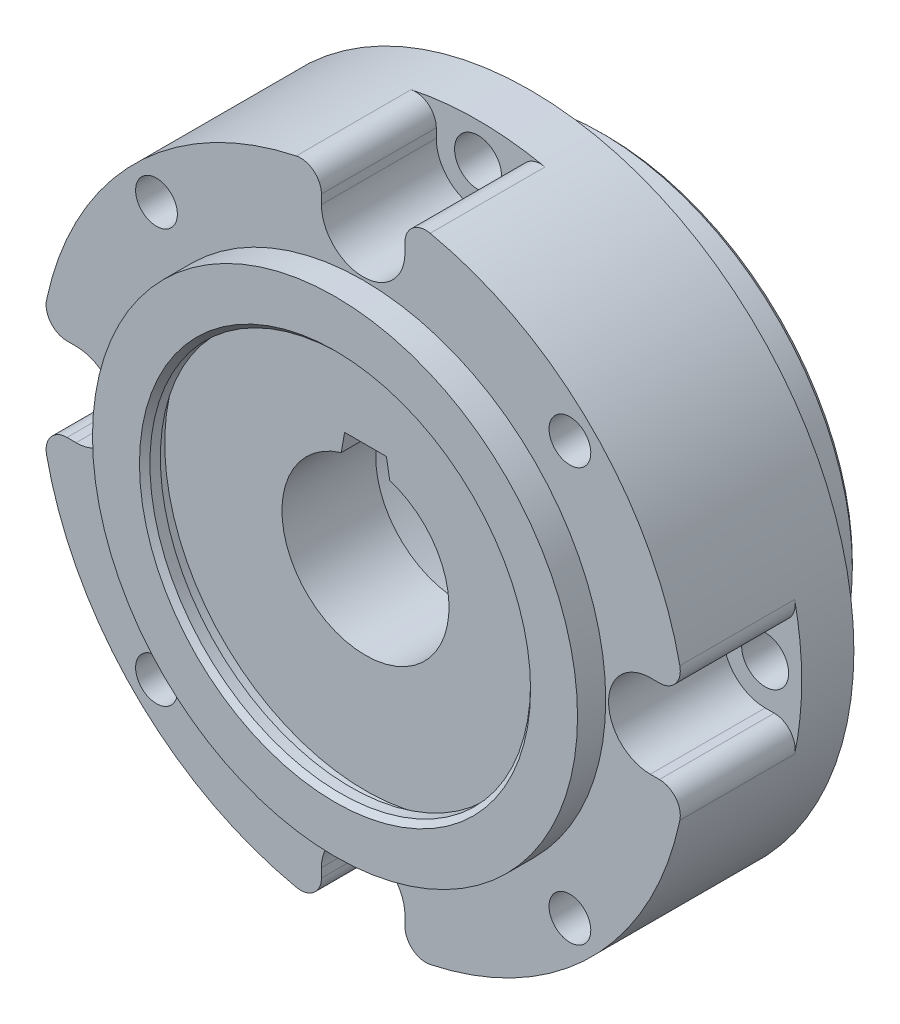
ISO-10303-21;
HEADER;
FILE_DESCRIPTION(('STEP AP214'),'2;1');
FILE_NAME('part.step','',(''),(''),'','','');
FILE_SCHEMA(('AUTOMOTIVE_DESIGN { 1 0 10303 214 1 1 1 1 }'));
ENDSEC;
DATA;
#1=APPLICATION_CONTEXT('core data for automotive mechanical design processes');
#2=APPLICATION_PROTOCOL_DEFINITION('international standard','automotive_design',2000,#1);
#3=PRODUCT_CONTEXT('',#1,'mechanical');
#4=PRODUCT('Part','Part','',(#3));
#5=PRODUCT_RELATED_PRODUCT_CATEGORY('part','',(#4));
#6=PRODUCT_DEFINITION_FORMATION('','',#4);
#7=PRODUCT_DEFINITION_CONTEXT('part definition',#1,'design');
#8=PRODUCT_DEFINITION('design','',#6,#7);
#9=PRODUCT_DEFINITION_SHAPE('','',#8);
#10=(LENGTH_UNIT() NAMED_UNIT(*) SI_UNIT(.MILLI.,.METRE.));
#11=(NAMED_UNIT(*) PLANE_ANGLE_UNIT() SI_UNIT($,.RADIAN.));
#12=(NAMED_UNIT(*) SI_UNIT($,.STERADIAN.) SOLID_ANGLE_UNIT());
#13=UNCERTAINTY_MEASURE_WITH_UNIT(LENGTH_MEASURE(1.E-05),#10,'distance_accuracy_value','');
#14=(GEOMETRIC_REPRESENTATION_CONTEXT(3) GLOBAL_UNCERTAINTY_ASSIGNED_CONTEXT((#13)) GLOBAL_UNIT_ASSIGNED_CONTEXT((#10,
#11,#12)) REPRESENTATION_CONTEXT('',''));
#15=CARTESIAN_POINT('',(0.,0.,0.));
#16=DIRECTION('',(0.,0.,1.));
#17=DIRECTION('',(1.,0.,0.));
#18=AXIS2_PLACEMENT_3D('',#15,#16,#17);
#19=CARTESIAN_POINT('',(0.,0.,-14.4918999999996));
#20=DIRECTION('',(0.,0.,-1.));
#21=DIRECTION('',(-1.,0.,0.));
#22=AXIS2_PLACEMENT_3D('',#19,#20,#21);
#23=TOROIDAL_SURFACE('',#22,15.3115518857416,0.508);
#24=CARTESIAN_POINT('',(0.,0.,-14.9998999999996));
#25=DIRECTION('',(0.,0.,-1.));
#26=DIRECTION('',(0.,1.,0.));
#27=AXIS2_PLACEMENT_3D('',#24,#25,#26);
#28=CIRCLE('',#27,15.3115518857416);
#29=CARTESIAN_POINT('',(0.,15.3115518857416,-14.9998999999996));
#30=VERTEX_POINT('',#29);
#31=EDGE_CURVE('E544',#30,#30,#28,.F.);
#32=ORIENTED_EDGE('',*,*,#31,.F.);
#33=EDGE_LOOP('',(#32));
#34=FACE_BOUND('',#33,.T.);
#35=CARTESIAN_POINT('',(0.,0.,-14.4918999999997));
#36=DIRECTION('',(0.,0.,-1.));
#37=DIRECTION('',(-1.,0.,0.));
#38=AXIS2_PLACEMENT_3D('',#35,#36,#37);
#39=CIRCLE('',#38,14.8035518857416);
#40=CARTESIAN_POINT('',(-14.8035518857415,0.,-14.4918999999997));
#41=VERTEX_POINT('',#40);
#42=EDGE_CURVE('E550',#41,#41,#39,.T.);
#43=ORIENTED_EDGE('',*,*,#42,.F.);
#44=EDGE_LOOP('',(#43));
#45=FACE_BOUND('',#44,.T.);
#46=ADVANCED_FACE('F47',(#34,#45),#23,.T.);
#47=CARTESIAN_POINT('',(0.,12.5287759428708,-11.8998999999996));
#48=DIRECTION('',(0.,0.,-1.));
#49=DIRECTION('',(-1.,0.,0.));
#50=AXIS2_PLACEMENT_3D('',#47,#48,#49);
#51=PLANE('',#50);
#52=CARTESIAN_POINT('',(0.,0.,-11.8998999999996));
#53=DIRECTION('',(0.,0.,-1.));
#54=DIRECTION('',(-1.,0.,0.));
#55=AXIS2_PLACEMENT_3D('',#52,#53,#54);
#56=CIRCLE('',#55,8.);
#57=CARTESIAN_POINT('',(2.32539816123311,7.65457532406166,-11.8998999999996));
#58=VERTEX_POINT('',#57);
#59=CARTESIAN_POINT('',(-2.32539816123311,7.65457532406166,-11.8998999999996));
#60=VERTEX_POINT('',#59);
#61=EDGE_CURVE('E471',#58,#60,#56,.T.);
#62=ORIENTED_EDGE('',*,*,#61,.F.);
#63=DIRECTION('',(0.173648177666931,-0.984807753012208,0.));
#64=VECTOR('',#63,1.);
#65=CARTESIAN_POINT('',(1.47405857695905,12.482762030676,-11.8998999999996));
#66=LINE('',#65,#64);
#67=CARTESIAN_POINT('',(2.,9.5,-11.8998999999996));
#68=VERTEX_POINT('',#67);
#69=EDGE_CURVE('E474',#68,#58,#66,.T.);
#70=ORIENTED_EDGE('',*,*,#69,.F.);
#71=DIRECTION('',(-1.,0.,0.));
#72=VECTOR('',#71,1.);
#73=CARTESIAN_POINT('',(0.,9.5,-11.8998999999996));
#74=LINE('',#73,#72);
#75=CARTESIAN_POINT('',(-2.,9.5,-11.8998999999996));
#76=VERTEX_POINT('',#75);
#77=EDGE_CURVE('E472',#68,#76,#74,.T.);
#78=ORIENTED_EDGE('',*,*,#77,.T.);
#79=DIRECTION('',(-0.173648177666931,-0.984807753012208,0.));
#80=VECTOR('',#79,1.);
#81=CARTESIAN_POINT('',(-1.47405857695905,12.482762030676,-11.8998999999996));
#82=LINE('',#81,#80);
#83=EDGE_CURVE('E468',#76,#60,#82,.T.);
#84=ORIENTED_EDGE('',*,*,#83,.T.);
#85=EDGE_LOOP('',(#62,#70,#78,#84));
#86=FACE_BOUND('',#85,.T.);
#87=CARTESIAN_POINT('',(0.,0.,-11.8998999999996));
#88=DIRECTION('',(0.,0.,1.));
#89=DIRECTION('',(1.,0.,0.));
#90=AXIS2_PLACEMENT_3D('',#87,#88,#89);
#91=CIRCLE('',#90,14.8035518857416);
#92=CARTESIAN_POINT('',(14.8035518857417,0.,-11.8998999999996));
#93=VERTEX_POINT('',#92);
#94=EDGE_CURVE('E554',#93,#93,#91,.F.);
#95=ORIENTED_EDGE('',*,*,#94,.T.);
#96=EDGE_LOOP('',(#95));
#97=FACE_BOUND('',#96,.T.);
#98=ADVANCED_FACE('F588',(#86,#97),#51,.T.);
#99=CARTESIAN_POINT('',(0.,14.7422305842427,-2.91989999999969));
#100=DIRECTION('',(0.,0.,1.));
#101=DIRECTION('',(1.,0.,0.));
#102=AXIS2_PLACEMENT_3D('',#99,#100,#101);
#103=PLANE('',#102);
#104=CARTESIAN_POINT('',(0.,0.,-2.91989999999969));
#105=DIRECTION('',(0.,0.,1.));
#106=DIRECTION('',(1.,0.,0.));
#107=AXIS2_PLACEMENT_3D('',#104,#105,#106);
#108=CIRCLE('',#107,8.);
#109=CARTESIAN_POINT('',(-2.32539816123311,7.65457532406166,-2.91989999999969));
#110=VERTEX_POINT('',#109);
#111=CARTESIAN_POINT('',(2.32539816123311,7.65457532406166,-2.91989999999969));
#112=VERTEX_POINT('',#111);
#113=EDGE_CURVE('E481',#110,#112,#108,.T.);
#114=ORIENTED_EDGE('',*,*,#113,.F.);
#115=DIRECTION('',(0.173648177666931,0.984807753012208,0.));
#116=VECTOR('',#115,1.);
#117=CARTESIAN_POINT('',(-2.30458468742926,7.77261439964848,-2.91989999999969));
#118=LINE('',#117,#116);
#119=CARTESIAN_POINT('',(-2.,9.5,-2.91989999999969));
#120=VERTEX_POINT('',#119);
#121=EDGE_CURVE('E475',#110,#120,#118,.T.);
#122=ORIENTED_EDGE('',*,*,#121,.T.);
#123=DIRECTION('',(1.,0.,0.));
#124=VECTOR('',#123,1.);
#125=CARTESIAN_POINT('',(-2.,9.5,-2.91989999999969));
#126=LINE('',#125,#124);
#127=CARTESIAN_POINT('',(2.,9.5,-2.91989999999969));
#128=VERTEX_POINT('',#127);
#129=EDGE_CURVE('E478',#120,#128,#126,.T.);
#130=ORIENTED_EDGE('',*,*,#129,.T.);
#131=DIRECTION('',(-0.173648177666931,0.984807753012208,0.));
#132=VECTOR('',#131,1.);
#133=CARTESIAN_POINT('',(2.30458468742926,7.77261439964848,-2.91989999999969));
#134=LINE('',#133,#132);
#135=EDGE_CURVE('E480',#112,#128,#134,.T.);
#136=ORIENTED_EDGE('',*,*,#135,.F.);
#137=EDGE_LOOP('',(#114,#122,#130,#136));
#138=FACE_BOUND('',#137,.T.);
#139=CARTESIAN_POINT('',(0.,0.,-2.91989999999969));
#140=DIRECTION('',(0.,0.,1.));
#141=DIRECTION('',(1.,0.,0.));
#142=AXIS2_PLACEMENT_3D('',#139,#140,#141);
#143=CIRCLE('',#142,19.2304611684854);
#144=CARTESIAN_POINT('',(19.2304611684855,0.,-2.91989999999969));
#145=VERTEX_POINT('',#144);
#146=EDGE_CURVE('E551',#145,#145,#143,.T.);
#147=ORIENTED_EDGE('',*,*,#146,.T.);
#148=EDGE_LOOP('',(#147));
#149=FACE_BOUND('',#148,.T.);
#150=ADVANCED_FACE('F594',(#138,#149),#103,.T.);
#151=CARTESIAN_POINT('',(0.,0.,-13.4498999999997));
#152=DIRECTION('',(0.,0.,1.));
#153=DIRECTION('',(1.,0.,0.));
#154=AXIS2_PLACEMENT_3D('',#151,#152,#153);
#155=CYLINDRICAL_SURFACE('',#154,14.8035518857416);
#156=ORIENTED_EDGE('',*,*,#94,.F.);
#157=EDGE_LOOP('',(#156));
#158=FACE_BOUND('',#157,.T.);
#159=ORIENTED_EDGE('',*,*,#42,.T.);
#160=EDGE_LOOP('',(#159));
#161=FACE_BOUND('',#160,.T.);
#162=ADVANCED_FACE('F711',(#158,#161),#155,.F.);
#163=CARTESIAN_POINT('',(0.,0.,-2.20989999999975));
#164=DIRECTION('',(0.,0.,1.));
#165=DIRECTION('',(1.,0.,0.));
#166=AXIS2_PLACEMENT_3D('',#163,#164,#165);
#167=CYLINDRICAL_SURFACE('',#166,19.2304611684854);
#168=ORIENTED_EDGE('',*,*,#146,.F.);
#169=EDGE_LOOP('',(#168));
#170=FACE_BOUND('',#169,.T.);
#171=CARTESIAN_POINT('',(0.,0.,-1.49989999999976));
#172=DIRECTION('',(0.,0.,1.));
#173=DIRECTION('',(1.,0.,0.));
#174=AXIS2_PLACEMENT_3D('',#171,#172,#173);
#175=CIRCLE('',#174,19.2304611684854);
#176=CARTESIAN_POINT('',(19.2304611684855,0.,-1.49989999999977));
#177=VERTEX_POINT('',#176);
#178=EDGE_CURVE('E547',#177,#177,#175,.F.);
#179=ORIENTED_EDGE('',*,*,#178,.F.);
#180=EDGE_LOOP('',(#179));
#181=FACE_BOUND('',#180,.T.);
#182=ADVANCED_FACE('F715',(#170,#181),#167,.F.);
#183=CARTESIAN_POINT('',(0.,18.7304611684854,-1.49989999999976));
#184=DIRECTION('',(0.,0.,-1.));
#185=DIRECTION('',(-1.,0.,0.));
#186=AXIS2_PLACEMENT_3D('',#183,#184,#185);
#187=PLANE('',#186);
#188=ORIENTED_EDGE('',*,*,#178,.T.);
#189=EDGE_LOOP('',(#188));
#190=FACE_BOUND('',#189,.T.);
#191=CARTESIAN_POINT('',(0.,0.,-1.49989999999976));
#192=DIRECTION('',(0.,0.,1.));
#193=DIRECTION('',(1.,0.,0.));
#194=AXIS2_PLACEMENT_3D('',#191,#192,#193);
#195=CIRCLE('',#194,18.2304611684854);
#196=CARTESIAN_POINT('',(18.2304611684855,0.,-1.49989999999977));
#197=VERTEX_POINT('',#196);
#198=EDGE_CURVE('E541',#197,#197,#195,.T.);
#199=ORIENTED_EDGE('',*,*,#198,.T.);
#200=EDGE_LOOP('',(#199));
#201=FACE_BOUND('',#200,.T.);
#202=ADVANCED_FACE('F719',(#190,#201),#187,.T.);
#203=CARTESIAN_POINT('',(0.,18.3035518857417,-14.9998999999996));
#204=DIRECTION('',(0.,0.,-1.));
#205=DIRECTION('',(-1.,0.,0.));
#206=AXIS2_PLACEMENT_3D('',#203,#204,#205);
#207=PLANE('',#206);
#208=CARTESIAN_POINT('',(0.,0.,-14.9998999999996));
#209=DIRECTION('',(0.,0.,1.));
#210=DIRECTION('',(1.,0.,0.));
#211=AXIS2_PLACEMENT_3D('',#208,#209,#210);
#212=CIRCLE('',#211,21.8035518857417);
#213=CARTESIAN_POINT('',(21.8035518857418,0.,-14.9998999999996));
#214=VERTEX_POINT('',#213);
#215=EDGE_CURVE('E538',#214,#214,#212,.F.);
#216=ORIENTED_EDGE('',*,*,#215,.T.);
#217=EDGE_LOOP('',(#216));
#218=FACE_BOUND('',#217,.T.);
#219=ORIENTED_EDGE('',*,*,#31,.T.);
#220=EDGE_LOOP('',(#219));
#221=FACE_BOUND('',#220,.T.);
#222=ADVANCED_FACE('F723',(#218,#221),#207,.T.);
#223=CARTESIAN_POINT('',(0.,0.,-0.999899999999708));
#224=DIRECTION('',(0.,0.,1.));
#225=DIRECTION('',(1.,0.,0.));
#226=AXIS2_PLACEMENT_3D('',#223,#224,#225);
#227=CYLINDRICAL_SURFACE('',#226,18.2304611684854);
#228=ORIENTED_EDGE('',*,*,#198,.F.);
#229=EDGE_LOOP('',(#228));
#230=FACE_BOUND('',#229,.T.);
#231=CARTESIAN_POINT('',(0.,0.,-0.499899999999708));
#232=DIRECTION('',(0.,0.,1.));
#233=DIRECTION('',(1.,0.,0.));
#234=AXIS2_PLACEMENT_3D('',#231,#232,#233);
#235=CIRCLE('',#234,18.2304611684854);
#236=CARTESIAN_POINT('',(18.2304611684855,0.,-0.499899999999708));
#237=VERTEX_POINT('',#236);
#238=EDGE_CURVE('E464',#237,#237,#235,.T.);
#239=ORIENTED_EDGE('',*,*,#238,.T.);
#240=EDGE_LOOP('',(#239));
#241=FACE_BOUND('',#240,.T.);
#242=ADVANCED_FACE('F583',(#230,#241),#227,.F.);
#243=CARTESIAN_POINT('',(0.,0.,-17.9998999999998));
#244=DIRECTION('',(0.,0.,1.));
#245=DIRECTION('',(1.,0.,0.));
#246=AXIS2_PLACEMENT_3D('',#243,#244,#245);
#247=CYLINDRICAL_SURFACE('',#246,21.8035518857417);
#248=ORIENTED_EDGE('',*,*,#215,.F.);
#249=EDGE_LOOP('',(#248));
#250=FACE_BOUND('',#249,.T.);
#251=CARTESIAN_POINT('',(0.,0.,-25.9999));
#252=DIRECTION('',(0.,0.,1.));
#253=DIRECTION('',(1.,0.,0.));
#254=AXIS2_PLACEMENT_3D('',#251,#252,#253);
#255=CIRCLE('',#254,21.8035518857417);
#256=CARTESIAN_POINT('',(21.8035518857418,0.,-25.9999));
#257=VERTEX_POINT('',#256);
#258=EDGE_CURVE('E461',#257,#257,#255,.T.);
#259=ORIENTED_EDGE('',*,*,#258,.F.);
#260=EDGE_LOOP('',(#259));
#261=FACE_BOUND('',#260,.T.);
#262=ADVANCED_FACE('F574',(#250,#261),#247,.F.);
#263=CARTESIAN_POINT('',(0.,0.,2.44942991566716E-05));
#264=DIRECTION('',(0.,0.,1.));
#265=DIRECTION('',(1.,0.,0.));
#266=AXIS2_PLACEMENT_3D('',#263,#264,#265);
#267=CONICAL_SURFACE('',#266,18.7303856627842,0.785398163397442);
#268=ORIENTED_EDGE('',*,*,#238,.F.);
#269=EDGE_LOOP('',(#268));
#270=FACE_BOUND('',#269,.T.);
#271=CARTESIAN_POINT('',(0.,0.,2.44942991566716E-05));
#272=DIRECTION('',(0.,0.,1.));
#273=DIRECTION('',(1.,0.,0.));
#274=AXIS2_PLACEMENT_3D('',#271,#272,#273);
#275=CIRCLE('',#274,18.7303856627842);
#276=CARTESIAN_POINT('',(18.7303856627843,0.,2.44942991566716E-05));
#277=VERTEX_POINT('',#276);
#278=EDGE_CURVE('E460',#277,#277,#275,.F.);
#279=ORIENTED_EDGE('',*,*,#278,.F.);
#280=EDGE_LOOP('',(#279));
#281=FACE_BOUND('',#280,.T.);
#282=ADVANCED_FACE('F572',(#270,#281),#267,.F.);
#283=CARTESIAN_POINT('',(0.,22.6785896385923,-25.9999));
#284=DIRECTION('',(0.,0.,-1.));
#285=DIRECTION('',(-1.,0.,0.));
#286=AXIS2_PLACEMENT_3D('',#283,#284,#285);
#287=PLANE('',#286);
#288=CARTESIAN_POINT('',(0.,0.,-25.9998999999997));
#289=DIRECTION('',(0.,0.,1.));
#290=DIRECTION('',(1.,0.,0.));
#291=AXIS2_PLACEMENT_3D('',#288,#289,#290);
#292=CIRCLE('',#291,23.5536273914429);
#293=CARTESIAN_POINT('',(23.553627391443,0.,-25.9998999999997));
#294=VERTEX_POINT('',#293);
#295=EDGE_CURVE('E457',#294,#294,#292,.T.);
#296=ORIENTED_EDGE('',*,*,#295,.F.);
#297=EDGE_LOOP('',(#296));
#298=FACE_BOUND('',#297,.T.);
#299=ORIENTED_EDGE('',*,*,#258,.T.);
#300=EDGE_LOOP('',(#299));
#301=FACE_BOUND('',#300,.T.);
#302=ADVANCED_FACE('F568',(#298,#301),#287,.T.);
#303=CARTESIAN_POINT('',(0.,21.4804234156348,2.44942991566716E-05));
#304=DIRECTION('',(0.,0.,1.));
#305=DIRECTION('',(1.,0.,0.));
#306=AXIS2_PLACEMENT_3D('',#303,#304,#305);
#307=PLANE('',#306);
#308=CARTESIAN_POINT('',(0.,0.,2.44942991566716E-05));
#309=DIRECTION('',(0.,0.,1.));
#310=DIRECTION('',(1.,0.,0.));
#311=AXIS2_PLACEMENT_3D('',#308,#309,#310);
#312=CIRCLE('',#311,23.2304611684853);
#313=CARTESIAN_POINT('',(23.2304611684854,0.,2.44942991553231E-05));
#314=VERTEX_POINT('',#313);
#315=EDGE_CURVE('E454',#314,#314,#312,.F.);
#316=ORIENTED_EDGE('',*,*,#315,.F.);
#317=EDGE_LOOP('',(#316));
#318=FACE_BOUND('',#317,.T.);
#319=ORIENTED_EDGE('',*,*,#278,.T.);
#320=EDGE_LOOP('',(#319));
#321=FACE_BOUND('',#320,.T.);
#322=ADVANCED_FACE('F564',(#318,#321),#307,.T.);
#323=CARTESIAN_POINT('',(11.8333000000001,-25.3766,-12.6999755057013));
#324=DIRECTION('',(0.,0.,-1.));
#325=DIRECTION('',(-1.,0.,0.));
#326=AXIS2_PLACEMENT_3D('',#323,#324,#325);
#327=PLANE('',#326);
#328=CARTESIAN_POINT('',(19.7989730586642,-19.79897679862,-12.6999755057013));
#329=DIRECTION('',(0.,0.,-1.));
#330=DIRECTION('',(-0.939692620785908,-0.342020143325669,0.));
#331=AXIS2_PLACEMENT_3D('',#328,#329,#330);
#332=CIRCLE('',#331,2.);
#333=CARTESIAN_POINT('',(17.9195878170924,-20.4830170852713,-12.6999755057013));
#334=VERTEX_POINT('',#333);
#335=EDGE_CURVE('E451',#334,#334,#332,.F.);
#336=ORIENTED_EDGE('',*,*,#335,.T.);
#337=EDGE_LOOP('',(#336));
#338=FACE_BOUND('',#337,.T.);
#339=ADVANCED_FACE('F567',(#338),#327,.F.);
#340=CARTESIAN_POINT('',(0.,0.,-25.4999755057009));
#341=DIRECTION('',(0.,0.,1.));
#342=DIRECTION('',(1.,0.,0.));
#343=AXIS2_PLACEMENT_3D('',#340,#341,#342);
#344=CONICAL_SURFACE('',#343,24.0535518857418,0.785398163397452);
#345=ORIENTED_EDGE('',*,*,#295,.T.);
#346=EDGE_LOOP('',(#345));
#347=FACE_BOUND('',#346,.T.);
#348=CARTESIAN_POINT('',(0.,0.,-25.4999755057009));
#349=DIRECTION('',(0.,0.,1.));
#350=DIRECTION('',(1.,0.,0.));
#351=AXIS2_PLACEMENT_3D('',#348,#349,#350);
#352=CIRCLE('',#351,24.0535518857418);
#353=CARTESIAN_POINT('',(24.0535518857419,0.,-25.4999755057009));
#354=VERTEX_POINT('',#353);
#355=EDGE_CURVE('E447',#354,#354,#352,.T.);
#356=ORIENTED_EDGE('',*,*,#355,.F.);
#357=EDGE_LOOP('',(#356));
#358=FACE_BOUND('',#357,.T.);
#359=ADVANCED_FACE('F635',(#347,#358),#344,.T.);
#360=CARTESIAN_POINT('',(-25.3765999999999,-11.8333,-12.6999755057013));
#361=DIRECTION('',(0.,0.,-1.));
#362=DIRECTION('',(-1.,0.,0.));
#363=AXIS2_PLACEMENT_3D('',#360,#361,#362);
#364=PLANE('',#363);
#365=CARTESIAN_POINT('',(-19.7989767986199,-19.798973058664,-12.6999755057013));
#366=DIRECTION('',(0.,0.,-1.));
#367=DIRECTION('',(-0.939692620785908,-0.342020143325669,0.));
#368=AXIS2_PLACEMENT_3D('',#365,#366,#367);
#369=CIRCLE('',#368,2.);
#370=CARTESIAN_POINT('',(-21.6783620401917,-20.4830133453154,-12.6999755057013));
#371=VERTEX_POINT('',#370);
#372=EDGE_CURVE('E441',#371,#371,#369,.F.);
#373=ORIENTED_EDGE('',*,*,#372,.T.);
#374=EDGE_LOOP('',(#373));
#375=FACE_BOUND('',#374,.T.);
#376=ADVANCED_FACE('F631',(#375),#364,.F.);
#377=CARTESIAN_POINT('',(-11.8332999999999,25.3766,-12.6999755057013));
#378=DIRECTION('',(0.,0.,-1.));
#379=DIRECTION('',(-1.,0.,0.));
#380=AXIS2_PLACEMENT_3D('',#377,#378,#379);
#381=PLANE('',#380);
#382=CARTESIAN_POINT('',(-19.798973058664,19.7989767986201,-12.6999755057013));
#383=DIRECTION('',(0.,0.,-1.));
#384=DIRECTION('',(-0.939692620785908,-0.342020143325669,0.));
#385=AXIS2_PLACEMENT_3D('',#382,#383,#384);
#386=CIRCLE('',#385,2.);
#387=CARTESIAN_POINT('',(-21.6783583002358,19.1149365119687,-12.6999755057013));
#388=VERTEX_POINT('',#387);
#389=EDGE_CURVE('E433',#388,#388,#386,.F.);
#390=ORIENTED_EDGE('',*,*,#389,.T.);
#391=EDGE_LOOP('',(#390));
#392=FACE_BOUND('',#391,.T.);
#393=ADVANCED_FACE('F627',(#392),#381,.F.);
#394=CARTESIAN_POINT('',(25.3766000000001,11.8333,-12.6999755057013));
#395=DIRECTION('',(0.,0.,-1.));
#396=DIRECTION('',(-1.,0.,0.));
#397=AXIS2_PLACEMENT_3D('',#394,#395,#396);
#398=PLANE('',#397);
#399=CARTESIAN_POINT('',(19.7989767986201,19.7989730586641,-12.6999755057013));
#400=DIRECTION('',(0.,0.,-1.));
#401=DIRECTION('',(-0.939692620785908,-0.342020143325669,0.));
#402=AXIS2_PLACEMENT_3D('',#399,#400,#401);
#403=CIRCLE('',#402,2.);
#404=CARTESIAN_POINT('',(17.9195915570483,19.1149327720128,-12.6999755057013));
#405=VERTEX_POINT('',#404);
#406=EDGE_CURVE('E429',#405,#405,#403,.F.);
#407=ORIENTED_EDGE('',*,*,#406,.T.);
#408=EDGE_LOOP('',(#407));
#409=FACE_BOUND('',#408,.T.);
#410=ADVANCED_FACE('F624',(#409),#398,.F.);
#411=CARTESIAN_POINT('',(0.,0.,-1.31343014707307));
#412=DIRECTION('',(0.,0.,1.));
#413=DIRECTION('',(1.,0.,0.));
#414=AXIS2_PLACEMENT_3D('',#411,#412,#413);
#415=CYLINDRICAL_SURFACE('',#414,23.2304611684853);
#416=ORIENTED_EDGE('',*,*,#315,.T.);
#417=EDGE_LOOP('',(#416));
#418=FACE_BOUND('',#417,.T.);
#419=CARTESIAN_POINT('',(0.,0.,-2.69997550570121));
#420=DIRECTION('',(0.,0.,1.));
#421=DIRECTION('',(1.,0.,0.));
#422=AXIS2_PLACEMENT_3D('',#419,#420,#421);
#423=CIRCLE('',#422,23.2304611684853);
#424=CARTESIAN_POINT('',(23.2304611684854,0.,-2.69997550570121));
#425=VERTEX_POINT('',#424);
#426=EDGE_CURVE('E342',#425,#425,#423,.T.);
#427=ORIENTED_EDGE('',*,*,#426,.T.);
#428=EDGE_LOOP('',(#427));
#429=FACE_BOUND('',#428,.T.);
#430=ADVANCED_FACE('F561',(#418,#429),#415,.T.);
#431=CARTESIAN_POINT('',(19.7989730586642,-19.79897679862,-2.69997550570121));
#432=DIRECTION('',(0.,0.,-1.));
#433=DIRECTION('',(-0.939692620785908,-0.342020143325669,0.));
#434=AXIS2_PLACEMENT_3D('',#431,#432,#433);
#435=CYLINDRICAL_SURFACE('',#434,2.);
#436=ORIENTED_EDGE('',*,*,#335,.F.);
#437=EDGE_LOOP('',(#436));
#438=FACE_BOUND('',#437,.T.);
#439=CARTESIAN_POINT('',(19.7989730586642,-19.79897679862,-2.69997550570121));
#440=DIRECTION('',(0.,0.,-1.));
#441=DIRECTION('',(-0.939692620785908,-0.342020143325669,0.));
#442=AXIS2_PLACEMENT_3D('',#439,#440,#441);
#443=CIRCLE('',#442,2.);
#444=CARTESIAN_POINT('',(17.9195878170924,-20.4830170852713,-2.69997550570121));
#445=VERTEX_POINT('',#444);
#446=EDGE_CURVE('E432',#445,#445,#443,.T.);
#447=ORIENTED_EDGE('',*,*,#446,.F.);
#448=EDGE_LOOP('',(#447));
#449=FACE_BOUND('',#448,.T.);
#450=ADVANCED_FACE('F622',(#438,#449),#435,.F.);
#451=CARTESIAN_POINT('',(0.,0.,-19.5999755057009));
#452=DIRECTION('',(0.,0.,1.));
#453=DIRECTION('',(1.,0.,0.));
#454=AXIS2_PLACEMENT_3D('',#451,#452,#453);
#455=CYLINDRICAL_SURFACE('',#454,24.0535518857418);
#456=ORIENTED_EDGE('',*,*,#355,.T.);
#457=EDGE_LOOP('',(#456));
#458=FACE_BOUND('',#457,.T.);
#459=CARTESIAN_POINT('',(0.,0.,-18.6999755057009));
#460=DIRECTION('',(0.,0.,1.));
#461=DIRECTION('',(1.,0.,0.));
#462=AXIS2_PLACEMENT_3D('',#459,#460,#461);
#463=CIRCLE('',#462,24.0535518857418);
#464=CARTESIAN_POINT('',(24.0535518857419,0.,-18.6999755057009));
#465=VERTEX_POINT('',#464);
#466=EDGE_CURVE('E450',#465,#465,#463,.T.);
#467=ORIENTED_EDGE('',*,*,#466,.F.);
#468=EDGE_LOOP('',(#467));
#469=FACE_BOUND('',#468,.T.);
#470=ADVANCED_FACE('F618',(#458,#469),#455,.T.);
#471=CARTESIAN_POINT('',(-19.7989767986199,-19.798973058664,-2.69997550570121));
#472=DIRECTION('',(0.,0.,-1.));
#473=DIRECTION('',(-0.939692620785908,-0.342020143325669,0.));
#474=AXIS2_PLACEMENT_3D('',#471,#472,#473);
#475=CYLINDRICAL_SURFACE('',#474,2.);
#476=ORIENTED_EDGE('',*,*,#372,.F.);
#477=EDGE_LOOP('',(#476));
#478=FACE_BOUND('',#477,.T.);
#479=CARTESIAN_POINT('',(-19.7989767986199,-19.798973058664,-2.69997550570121));
#480=DIRECTION('',(0.,0.,-1.));
#481=DIRECTION('',(-0.939692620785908,-0.342020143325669,0.));
#482=AXIS2_PLACEMENT_3D('',#479,#480,#481);
#483=CIRCLE('',#482,2.);
#484=CARTESIAN_POINT('',(-21.6783620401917,-20.4830133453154,-2.69997550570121));
#485=VERTEX_POINT('',#484);
#486=EDGE_CURVE('E444',#485,#485,#483,.T.);
#487=ORIENTED_EDGE('',*,*,#486,.F.);
#488=EDGE_LOOP('',(#487));
#489=FACE_BOUND('',#488,.T.);
#490=ADVANCED_FACE('F621',(#478,#489),#475,.F.);
#491=CARTESIAN_POINT('',(-19.798973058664,19.7989767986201,-2.69997550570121));
#492=DIRECTION('',(0.,0.,-1.));
#493=DIRECTION('',(-0.939692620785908,-0.342020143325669,0.));
#494=AXIS2_PLACEMENT_3D('',#491,#492,#493);
#495=CYLINDRICAL_SURFACE('',#494,2.);
#496=ORIENTED_EDGE('',*,*,#389,.F.);
#497=EDGE_LOOP('',(#496));
#498=FACE_BOUND('',#497,.T.);
#499=CARTESIAN_POINT('',(-19.798973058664,19.7989767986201,-2.69997550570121));
#500=DIRECTION('',(0.,0.,-1.));
#501=DIRECTION('',(-0.939692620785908,-0.342020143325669,0.));
#502=AXIS2_PLACEMENT_3D('',#499,#500,#501);
#503=CIRCLE('',#502,2.);
#504=CARTESIAN_POINT('',(-21.6783583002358,19.1149365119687,-2.69997550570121));
#505=VERTEX_POINT('',#504);
#506=EDGE_CURVE('E438',#505,#505,#503,.T.);
#507=ORIENTED_EDGE('',*,*,#506,.F.);
#508=EDGE_LOOP('',(#507));
#509=FACE_BOUND('',#508,.T.);
#510=ADVANCED_FACE('F658',(#498,#509),#495,.F.);
#511=CARTESIAN_POINT('',(19.7989767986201,19.7989730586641,-2.69997550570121));
#512=DIRECTION('',(0.,0.,-1.));
#513=DIRECTION('',(-0.939692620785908,-0.342020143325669,0.));
#514=AXIS2_PLACEMENT_3D('',#511,#512,#513);
#515=CYLINDRICAL_SURFACE('',#514,2.);
#516=ORIENTED_EDGE('',*,*,#406,.F.);
#517=EDGE_LOOP('',(#516));
#518=FACE_BOUND('',#517,.T.);
#519=CARTESIAN_POINT('',(19.7989767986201,19.7989730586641,-2.69997550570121));
#520=DIRECTION('',(0.,0.,-1.));
#521=DIRECTION('',(-0.939692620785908,-0.342020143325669,0.));
#522=AXIS2_PLACEMENT_3D('',#519,#520,#521);
#523=CIRCLE('',#522,2.);
#524=CARTESIAN_POINT('',(17.9195915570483,19.1149327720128,-2.69997550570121));
#525=VERTEX_POINT('',#524);
#526=EDGE_CURVE('E434',#525,#525,#523,.T.);
#527=ORIENTED_EDGE('',*,*,#526,.F.);
#528=EDGE_LOOP('',(#527));
#529=FACE_BOUND('',#528,.T.);
#530=ADVANCED_FACE('F616',(#518,#529),#515,.F.);
#531=CARTESIAN_POINT('',(0.,27.6517759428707,-2.69997550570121));
#532=DIRECTION('',(0.,0.,1.));
#533=DIRECTION('',(1.,0.,0.));
#534=AXIS2_PLACEMENT_3D('',#531,#532,#533);
#535=PLANE('',#534);
#536=CARTESIAN_POINT('',(0.,0.,-2.69997550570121));
#537=DIRECTION('',(0.,0.,1.));
#538=DIRECTION('',(1.,0.,0.));
#539=AXIS2_PLACEMENT_3D('',#536,#537,#538);
#540=CIRCLE('',#539,30.9999999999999);
#541=CARTESIAN_POINT('',(30.3292475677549,-6.41379310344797,-2.69997550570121));
#542=VERTEX_POINT('',#541);
#543=CARTESIAN_POINT('',(6.41379310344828,-30.3292475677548,-2.69997550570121));
#544=VERTEX_POINT('',#543);
#545=EDGE_CURVE('E775',#542,#544,#540,.F.);
#546=ORIENTED_EDGE('',*,*,#545,.F.);
#547=CARTESIAN_POINT('',(28.3725219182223,-5.99999999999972,-2.69997550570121));
#548=DIRECTION('',(0.,0.,1.));
#549=DIRECTION('',(1.,0.,0.));
#550=AXIS2_PLACEMENT_3D('',#547,#548,#549);
#551=CIRCLE('',#550,2.);
#552=CARTESIAN_POINT('',(28.3725219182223,-3.99999999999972,-2.69997550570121));
#553=VERTEX_POINT('',#552);
#554=EDGE_CURVE('E420',#542,#553,#551,.T.);
#555=ORIENTED_EDGE('',*,*,#554,.T.);
#556=DIRECTION('',(1.,0.,0.));
#557=VECTOR('',#556,1.);
#558=CARTESIAN_POINT('',(30.7408522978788,-3.99999999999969,-2.69997550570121));
#559=LINE('',#558,#557);
#560=CARTESIAN_POINT('',(27.4999999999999,-3.99999999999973,-2.69997550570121));
#561=VERTEX_POINT('',#560);
#562=EDGE_CURVE('E300',#561,#553,#559,.T.);
#563=ORIENTED_EDGE('',*,*,#562,.F.);
#564=CARTESIAN_POINT('',(27.5,2.88495769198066E-13,-2.69997550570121));
#565=DIRECTION('',(0.,0.,1.));
#566=DIRECTION('',(0.,-1.,0.));
#567=AXIS2_PLACEMENT_3D('',#564,#565,#566);
#568=CIRCLE('',#567,4.00000000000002);
#569=CARTESIAN_POINT('',(27.4999999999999,4.0000000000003,-2.69997550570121));
#570=VERTEX_POINT('',#569);
#571=EDGE_CURVE('E309',#570,#561,#568,.T.);
#572=ORIENTED_EDGE('',*,*,#571,.F.);
#573=DIRECTION('',(-1.,0.,0.));
#574=VECTOR('',#573,1.);
#575=CARTESIAN_POINT('',(30.7408522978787,4.00000000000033,-2.69997550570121));
#576=LINE('',#575,#574);
#577=CARTESIAN_POINT('',(28.3725219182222,4.00000000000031,-2.69997550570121));
#578=VERTEX_POINT('',#577);
#579=EDGE_CURVE('E307',#578,#570,#576,.T.);
#580=ORIENTED_EDGE('',*,*,#579,.F.);
#581=CARTESIAN_POINT('',(28.3725219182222,6.00000000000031,-2.69997550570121));
#582=DIRECTION('',(0.,0.,1.));
#583=DIRECTION('',(1.,0.,0.));
#584=AXIS2_PLACEMENT_3D('',#581,#582,#583);
#585=CIRCLE('',#584,2.);
#586=CARTESIAN_POINT('',(30.3292475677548,6.41379310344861,-2.69997550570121));
#587=VERTEX_POINT('',#586);
#588=EDGE_CURVE('E418',#578,#587,#585,.T.);
#589=ORIENTED_EDGE('',*,*,#588,.T.);
#590=CARTESIAN_POINT('',(6.41379310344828,30.3292475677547,-2.69997550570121));
#591=VERTEX_POINT('',#590);
#592=EDGE_CURVE('E532',#591,#587,#540,.F.);
#593=ORIENTED_EDGE('',*,*,#592,.F.);
#594=CARTESIAN_POINT('',(6.00000000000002,28.3725219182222,-2.69997550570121));
#595=DIRECTION('',(0.,0.,1.));
#596=DIRECTION('',(1.,0.,0.));
#597=AXIS2_PLACEMENT_3D('',#594,#595,#596);
#598=CIRCLE('',#597,2.);
#599=CARTESIAN_POINT('',(4.00000000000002,28.3725219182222,-2.69997550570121));
#600=VERTEX_POINT('',#599);
#601=EDGE_CURVE('E354',#591,#600,#598,.T.);
#602=ORIENTED_EDGE('',*,*,#601,.T.);
#603=DIRECTION('',(0.,1.,0.));
#604=VECTOR('',#603,1.);
#605=CARTESIAN_POINT('',(4.00000000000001,30.7408522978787,-2.69997550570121));
#606=LINE('',#605,#604);
#607=CARTESIAN_POINT('',(4.00000000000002,27.4999999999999,-2.69997550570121));
#608=VERTEX_POINT('',#607);
#609=EDGE_CURVE('E327',#608,#600,#606,.T.);
#610=ORIENTED_EDGE('',*,*,#609,.F.);
#611=CARTESIAN_POINT('',(0.,27.5,-2.69997550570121));
#612=DIRECTION('',(0.,0.,1.));
#613=DIRECTION('',(1.,0.,0.));
#614=AXIS2_PLACEMENT_3D('',#611,#612,#613);
#615=CIRCLE('',#614,4.00000000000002);
#616=CARTESIAN_POINT('',(-4.00000000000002,27.4999999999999,-2.69997550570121));
#617=VERTEX_POINT('',#616);
#618=EDGE_CURVE('E335',#617,#608,#615,.T.);
#619=ORIENTED_EDGE('',*,*,#618,.F.);
#620=DIRECTION('',(0.,-1.,0.));
#621=VECTOR('',#620,1.);
#622=CARTESIAN_POINT('',(-4.,30.7408522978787,-2.69997550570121));
#623=LINE('',#622,#621);
#624=CARTESIAN_POINT('',(-4.00000000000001,28.3725219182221,-2.69997550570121));
#625=VERTEX_POINT('',#624);
#626=EDGE_CURVE('E323',#625,#617,#623,.T.);
#627=ORIENTED_EDGE('',*,*,#626,.F.);
#628=CARTESIAN_POINT('',(-6.00000000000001,28.3725219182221,-2.69997550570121));
#629=DIRECTION('',(0.,0.,1.));
#630=DIRECTION('',(1.,0.,0.));
#631=AXIS2_PLACEMENT_3D('',#628,#629,#630);
#632=CIRCLE('',#631,2.);
#633=CARTESIAN_POINT('',(-6.4137931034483,30.3292475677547,-2.69997550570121));
#634=VERTEX_POINT('',#633);
#635=EDGE_CURVE('E351',#625,#634,#632,.T.);
#636=ORIENTED_EDGE('',*,*,#635,.T.);
#637=CARTESIAN_POINT('',(-30.3292475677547,6.41379310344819,-2.69997550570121));
#638=VERTEX_POINT('',#637);
#639=EDGE_CURVE('E528',#638,#634,#540,.F.);
#640=ORIENTED_EDGE('',*,*,#639,.F.);
#641=CARTESIAN_POINT('',(-28.3725219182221,5.99999999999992,-2.69997550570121));
#642=DIRECTION('',(0.,0.,1.));
#643=DIRECTION('',(1.,0.,0.));
#644=AXIS2_PLACEMENT_3D('',#641,#642,#643);
#645=CIRCLE('',#644,2.);
#646=CARTESIAN_POINT('',(-28.3725219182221,3.99999999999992,-2.69997550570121));
#647=VERTEX_POINT('',#646);
#648=EDGE_CURVE('E381',#638,#647,#645,.T.);
#649=ORIENTED_EDGE('',*,*,#648,.T.);
#650=DIRECTION('',(-1.,0.,0.));
#651=VECTOR('',#650,1.);
#652=CARTESIAN_POINT('',(-30.7408522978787,3.99999999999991,-2.69997550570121));
#653=LINE('',#652,#651);
#654=CARTESIAN_POINT('',(-27.4999999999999,3.99999999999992,-2.69997550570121));
#655=VERTEX_POINT('',#654);
#656=EDGE_CURVE('E250',#655,#647,#653,.T.);
#657=ORIENTED_EDGE('',*,*,#656,.F.);
#658=CARTESIAN_POINT('',(-27.5,0.,-2.69997550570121));
#659=DIRECTION('',(0.,0.,1.));
#660=DIRECTION('',(0.,1.,0.));
#661=AXIS2_PLACEMENT_3D('',#658,#659,#660);
#662=CIRCLE('',#661,4.00000000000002);
#663=CARTESIAN_POINT('',(-27.4999999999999,-4.00000000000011,-2.69997550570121));
#664=VERTEX_POINT('',#663);
#665=EDGE_CURVE('E269',#664,#655,#662,.T.);
#666=ORIENTED_EDGE('',*,*,#665,.F.);
#667=DIRECTION('',(1.,0.,0.));
#668=VECTOR('',#667,1.);
#669=CARTESIAN_POINT('',(-30.7408522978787,-4.00000000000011,-2.69997550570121));
#670=LINE('',#669,#668);
#671=CARTESIAN_POINT('',(-28.372521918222,-4.00000000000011,-2.69997550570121));
#672=VERTEX_POINT('',#671);
#673=EDGE_CURVE('E256',#672,#664,#670,.T.);
#674=ORIENTED_EDGE('',*,*,#673,.F.);
#675=CARTESIAN_POINT('',(-28.372521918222,-6.00000000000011,-2.69997550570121));
#676=DIRECTION('',(0.,0.,1.));
#677=DIRECTION('',(1.,0.,0.));
#678=AXIS2_PLACEMENT_3D('',#675,#676,#677);
#679=CIRCLE('',#678,2.);
#680=CARTESIAN_POINT('',(-30.3292475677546,-6.4137931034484,-2.69997550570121));
#681=VERTEX_POINT('',#680);
#682=EDGE_CURVE('E378',#672,#681,#679,.T.);
#683=ORIENTED_EDGE('',*,*,#682,.T.);
#684=CARTESIAN_POINT('',(-6.4137931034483,-30.3292475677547,-2.69997550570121));
#685=VERTEX_POINT('',#684);
#686=EDGE_CURVE('E530',#685,#681,#540,.F.);
#687=ORIENTED_EDGE('',*,*,#686,.F.);
#688=CARTESIAN_POINT('',(-6.00000000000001,-28.3725219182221,-2.69997550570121));
#689=DIRECTION('',(0.,0.,1.));
#690=DIRECTION('',(1.,0.,0.));
#691=AXIS2_PLACEMENT_3D('',#688,#689,#690);
#692=CIRCLE('',#691,2.);
#693=CARTESIAN_POINT('',(-4.00000000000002,-28.3725219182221,-2.69997550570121));
#694=VERTEX_POINT('',#693);
#695=EDGE_CURVE('E400',#685,#694,#692,.T.);
#696=ORIENTED_EDGE('',*,*,#695,.T.);
#697=DIRECTION('',(0.,-1.,0.));
#698=VECTOR('',#697,1.);
#699=CARTESIAN_POINT('',(-4.00000000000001,-30.7408522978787,-2.69997550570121));
#700=LINE('',#699,#698);
#701=CARTESIAN_POINT('',(-4.00000000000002,-27.4999999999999,-2.69997550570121));
#702=VERTEX_POINT('',#701);
#703=EDGE_CURVE('E279',#702,#694,#700,.T.);
#704=ORIENTED_EDGE('',*,*,#703,.F.);
#705=CARTESIAN_POINT('',(0.,-27.5,-2.69997550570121));
#706=DIRECTION('',(0.,0.,1.));
#707=DIRECTION('',(-1.,0.,0.));
#708=AXIS2_PLACEMENT_3D('',#705,#706,#707);
#709=CIRCLE('',#708,4.00000000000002);
#710=CARTESIAN_POINT('',(4.00000000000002,-27.4999999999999,-2.69997550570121));
#711=VERTEX_POINT('',#710);
#712=EDGE_CURVE('E288',#711,#702,#709,.T.);
#713=ORIENTED_EDGE('',*,*,#712,.F.);
#714=DIRECTION('',(0.,1.,0.));
#715=VECTOR('',#714,1.);
#716=CARTESIAN_POINT('',(4.,-30.7408522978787,-2.69997550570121));
#717=LINE('',#716,#715);
#718=CARTESIAN_POINT('',(4.00000000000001,-28.3725219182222,-2.69997550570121));
#719=VERTEX_POINT('',#718);
#720=EDGE_CURVE('E286',#719,#711,#717,.T.);
#721=ORIENTED_EDGE('',*,*,#720,.F.);
#722=CARTESIAN_POINT('',(6.00000000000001,-28.3725219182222,-2.69997550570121));
#723=DIRECTION('',(0.,0.,1.));
#724=DIRECTION('',(1.,0.,0.));
#725=AXIS2_PLACEMENT_3D('',#722,#723,#724);
#726=CIRCLE('',#725,2.);
#727=EDGE_CURVE('E397',#719,#544,#726,.T.);
#728=ORIENTED_EDGE('',*,*,#727,.T.);
#729=EDGE_LOOP('',(#546,#555,#563,#572,#580,#589,#593,#602,#610,#619,#627,#636,#640,#649,#657,
#666,#674,#683,#687,#696,#704,#713,#721,#728));
#730=FACE_BOUND('',#729,.T.);
#731=ORIENTED_EDGE('',*,*,#426,.F.);
#732=EDGE_LOOP('',(#731));
#733=FACE_BOUND('',#732,.T.);
#734=ORIENTED_EDGE('',*,*,#446,.T.);
#735=EDGE_LOOP('',(#734));
#736=FACE_BOUND('',#735,.T.);
#737=ORIENTED_EDGE('',*,*,#486,.T.);
#738=EDGE_LOOP('',(#737));
#739=FACE_BOUND('',#738,.T.);
#740=ORIENTED_EDGE('',*,*,#526,.T.);
#741=EDGE_LOOP('',(#740));
#742=FACE_BOUND('',#741,.T.);
#743=ORIENTED_EDGE('',*,*,#506,.T.);
#744=EDGE_LOOP('',(#743));
#745=FACE_BOUND('',#744,.T.);
#746=ADVANCED_FACE('F517',(#730,#733,#736,#739,#742,#745),#535,.T.);
#747=CARTESIAN_POINT('',(0.,27.5267759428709,-18.6999755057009));
#748=DIRECTION('',(0.,0.,-1.));
#749=DIRECTION('',(-1.,0.,0.));
#750=AXIS2_PLACEMENT_3D('',#747,#748,#749);
#751=PLANE('',#750);
#752=CARTESIAN_POINT('',(27.5,2.86957509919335E-13,-18.6999755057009));
#753=DIRECTION('',(0.,0.,-1.));
#754=DIRECTION('',(-1.,0.,0.));
#755=AXIS2_PLACEMENT_3D('',#752,#753,#754);
#756=CIRCLE('',#755,2.25);
#757=CARTESIAN_POINT('',(25.25,2.86957509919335E-13,-18.6999755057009));
#758=VERTEX_POINT('',#757);
#759=EDGE_CURVE('E496',#758,#758,#756,.T.);
#760=ORIENTED_EDGE('',*,*,#759,.F.);
#761=EDGE_LOOP('',(#760));
#762=FACE_BOUND('',#761,.T.);
#763=CARTESIAN_POINT('',(0.,-27.5,-18.6999755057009));
#764=DIRECTION('',(0.,0.,-1.));
#765=DIRECTION('',(-1.,0.,0.));
#766=AXIS2_PLACEMENT_3D('',#763,#764,#765);
#767=CIRCLE('',#766,2.25);
#768=CARTESIAN_POINT('',(-2.25,-27.5,-18.6999755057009));
#769=VERTEX_POINT('',#768);
#770=EDGE_CURVE('E502',#769,#769,#767,.T.);
#771=ORIENTED_EDGE('',*,*,#770,.F.);
#772=EDGE_LOOP('',(#771));
#773=FACE_BOUND('',#772,.T.);
#774=CARTESIAN_POINT('',(-27.5,0.,-18.6999755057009));
#775=DIRECTION('',(0.,0.,-1.));
#776=DIRECTION('',(-1.,0.,0.));
#777=AXIS2_PLACEMENT_3D('',#774,#775,#776);
#778=CIRCLE('',#777,2.25);
#779=CARTESIAN_POINT('',(-29.75,0.,-18.6999755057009));
#780=VERTEX_POINT('',#779);
#781=EDGE_CURVE('E310',#780,#780,#778,.T.);
#782=ORIENTED_EDGE('',*,*,#781,.F.);
#783=EDGE_LOOP('',(#782));
#784=FACE_BOUND('',#783,.T.);
#785=CARTESIAN_POINT('',(0.,27.5,-18.6999755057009));
#786=DIRECTION('',(0.,0.,-1.));
#787=DIRECTION('',(-1.,0.,0.));
#788=AXIS2_PLACEMENT_3D('',#785,#786,#787);
#789=CIRCLE('',#788,2.25);
#790=CARTESIAN_POINT('',(-2.25,27.5,-18.6999755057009));
#791=VERTEX_POINT('',#790);
#792=EDGE_CURVE('E320',#791,#791,#789,.T.);
#793=ORIENTED_EDGE('',*,*,#792,.F.);
#794=EDGE_LOOP('',(#793));
#795=FACE_BOUND('',#794,.T.);
#796=ORIENTED_EDGE('',*,*,#466,.T.);
#797=EDGE_LOOP('',(#796));
#798=FACE_BOUND('',#797,.T.);
#799=CARTESIAN_POINT('',(0.,0.,-18.6999755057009));
#800=DIRECTION('',(0.,0.,1.));
#801=DIRECTION('',(1.,0.,0.));
#802=AXIS2_PLACEMENT_3D('',#799,#800,#801);
#803=CIRCLE('',#802,30.9999999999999);
#804=CARTESIAN_POINT('',(31.,0.,-18.699975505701));
#805=VERTEX_POINT('',#804);
#806=EDGE_CURVE('E437',#805,#805,#803,.T.);
#807=ORIENTED_EDGE('',*,*,#806,.F.);
#808=EDGE_LOOP('',(#807));
#809=FACE_BOUND('',#808,.T.);
#810=ADVANCED_FACE('F513',(#762,#773,#784,#795,#798,#809),#751,.T.);
#811=CARTESIAN_POINT('',(0.,0.,-10.6999755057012));
#812=DIRECTION('',(0.,0.,1.));
#813=DIRECTION('',(1.,0.,0.));
#814=AXIS2_PLACEMENT_3D('',#811,#812,#813);
#815=CYLINDRICAL_SURFACE('',#814,30.9999999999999);
#816=CARTESIAN_POINT('',(0.,0.,-13.6999755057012));
#817=DIRECTION('',(0.,0.,1.));
#818=DIRECTION('',(1.,0.,0.));
#819=AXIS2_PLACEMENT_3D('',#816,#817,#818);
#820=CIRCLE('',#819,30.9999999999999);
#821=CARTESIAN_POINT('',(30.3292475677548,6.41379310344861,-13.6999755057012));
#822=VERTEX_POINT('',#821);
#823=CARTESIAN_POINT('',(30.3292475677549,-6.41379310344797,-13.6999755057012));
#824=VERTEX_POINT('',#823);
#825=EDGE_CURVE('E366',#822,#824,#820,.F.);
#826=ORIENTED_EDGE('',*,*,#825,.T.);
#827=DIRECTION('',(0.,0.,1.));
#828=VECTOR('',#827,1.);
#829=CARTESIAN_POINT('',(30.3292475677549,-6.41379310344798,-10.6999755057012));
#830=LINE('',#829,#828);
#831=EDGE_CURVE('E415',#824,#542,#830,.T.);
#832=ORIENTED_EDGE('',*,*,#831,.T.);
#833=ORIENTED_EDGE('',*,*,#545,.T.);
#834=DIRECTION('',(0.,0.,1.));
#835=VECTOR('',#834,1.);
#836=CARTESIAN_POINT('',(6.41379310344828,-30.3292475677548,-10.6999755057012));
#837=LINE('',#836,#835);
#838=CARTESIAN_POINT('',(6.41379310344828,-30.3292475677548,-13.6999755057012));
#839=VERTEX_POINT('',#838);
#840=EDGE_CURVE('E391',#544,#839,#837,.F.);
#841=ORIENTED_EDGE('',*,*,#840,.T.);
#842=CARTESIAN_POINT('',(0.,0.,-13.6999755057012));
#843=DIRECTION('',(0.,0.,1.));
#844=DIRECTION('',(1.,0.,0.));
#845=AXIS2_PLACEMENT_3D('',#842,#843,#844);
#846=CIRCLE('',#845,30.9999999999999);
#847=CARTESIAN_POINT('',(-6.4137931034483,-30.3292475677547,-13.6999755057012));
#848=VERTEX_POINT('',#847);
#849=EDGE_CURVE('E368',#839,#848,#846,.F.);
#850=ORIENTED_EDGE('',*,*,#849,.T.);
#851=DIRECTION('',(0.,0.,1.));
#852=VECTOR('',#851,1.);
#853=CARTESIAN_POINT('',(-6.4137931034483,-30.3292475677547,-10.6999755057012));
#854=LINE('',#853,#852);
#855=EDGE_CURVE('E394',#848,#685,#854,.T.);
#856=ORIENTED_EDGE('',*,*,#855,.T.);
#857=ORIENTED_EDGE('',*,*,#686,.T.);
#858=DIRECTION('',(0.,0.,1.));
#859=VECTOR('',#858,1.);
#860=CARTESIAN_POINT('',(-30.3292475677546,-6.4137931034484,-10.6999755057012));
#861=LINE('',#860,#859);
#862=CARTESIAN_POINT('',(-30.3292475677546,-6.4137931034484,-13.6999755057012));
#863=VERTEX_POINT('',#862);
#864=EDGE_CURVE('E372',#681,#863,#861,.F.);
#865=ORIENTED_EDGE('',*,*,#864,.T.);
#866=CARTESIAN_POINT('',(0.,0.,-13.6999755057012));
#867=DIRECTION('',(0.,0.,1.));
#868=DIRECTION('',(0.,-1.,0.));
#869=AXIS2_PLACEMENT_3D('',#866,#867,#868);
#870=CIRCLE('',#869,30.9999999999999);
#871=CARTESIAN_POINT('',(-30.3292475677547,6.41379310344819,-13.6999755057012));
#872=VERTEX_POINT('',#871);
#873=EDGE_CURVE('E370',#863,#872,#870,.F.);
#874=ORIENTED_EDGE('',*,*,#873,.T.);
#875=DIRECTION('',(0.,0.,1.));
#876=VECTOR('',#875,1.);
#877=CARTESIAN_POINT('',(-30.3292475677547,6.41379310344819,-10.6999755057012));
#878=LINE('',#877,#876);
#879=EDGE_CURVE('E375',#872,#638,#878,.T.);
#880=ORIENTED_EDGE('',*,*,#879,.T.);
#881=ORIENTED_EDGE('',*,*,#639,.T.);
#882=DIRECTION('',(0.,0.,1.));
#883=VECTOR('',#882,1.);
#884=CARTESIAN_POINT('',(-6.4137931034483,30.3292475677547,-10.6999755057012));
#885=LINE('',#884,#883);
#886=CARTESIAN_POINT('',(-6.4137931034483,30.3292475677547,-13.6999755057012));
#887=VERTEX_POINT('',#886);
#888=EDGE_CURVE('E344',#634,#887,#885,.F.);
#889=ORIENTED_EDGE('',*,*,#888,.T.);
#890=CARTESIAN_POINT('',(0.,0.,-13.6999755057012));
#891=DIRECTION('',(0.,0.,1.));
#892=DIRECTION('',(1.,0.,0.));
#893=AXIS2_PLACEMENT_3D('',#890,#891,#892);
#894=CIRCLE('',#893,30.9999999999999);
#895=CARTESIAN_POINT('',(6.41379310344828,30.3292475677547,-13.6999755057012));
#896=VERTEX_POINT('',#895);
#897=EDGE_CURVE('E348',#887,#896,#894,.F.);
#898=ORIENTED_EDGE('',*,*,#897,.T.);
#899=DIRECTION('',(0.,0.,1.));
#900=VECTOR('',#899,1.);
#901=CARTESIAN_POINT('',(6.41379310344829,30.3292475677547,-10.6999755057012));
#902=LINE('',#901,#900);
#903=EDGE_CURVE('E347',#896,#591,#902,.T.);
#904=ORIENTED_EDGE('',*,*,#903,.T.);
#905=ORIENTED_EDGE('',*,*,#592,.T.);
#906=DIRECTION('',(0.,0.,1.));
#907=VECTOR('',#906,1.);
#908=CARTESIAN_POINT('',(30.3292475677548,6.41379310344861,-10.6999755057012));
#909=LINE('',#908,#907);
#910=EDGE_CURVE('E412',#587,#822,#909,.F.);
#911=ORIENTED_EDGE('',*,*,#910,.T.);
#912=EDGE_LOOP('',(#826,#832,#833,#841,#850,#856,#857,#865,#874,#880,#881,#889,#898,#904,#905,#911));
#913=FACE_BOUND('',#912,.T.);
#914=ORIENTED_EDGE('',*,*,#806,.T.);
#915=EDGE_LOOP('',(#914));
#916=FACE_BOUND('',#915,.T.);
#917=ADVANCED_FACE('F516',(#913,#916),#815,.T.);
#918=CARTESIAN_POINT('',(4.00000000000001,30.7408522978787,-13.6999755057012));
#919=DIRECTION('',(1.,0.,0.));
#920=DIRECTION('',(0.,1.,0.));
#921=AXIS2_PLACEMENT_3D('',#918,#919,#920);
#922=PLANE('',#921);
#923=ORIENTED_EDGE('',*,*,#609,.T.);
#924=DIRECTION('',(0.,0.,-1.));
#925=VECTOR('',#924,1.);
#926=CARTESIAN_POINT('',(4.00000000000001,28.3725219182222,-13.6999755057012));
#927=LINE('',#926,#925);
#928=CARTESIAN_POINT('',(4.00000000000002,28.3725219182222,-13.6999755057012));
#929=VERTEX_POINT('',#928);
#930=EDGE_CURVE('E356',#600,#929,#927,.T.);
#931=ORIENTED_EDGE('',*,*,#930,.T.);
#932=DIRECTION('',(0.,1.,0.));
#933=VECTOR('',#932,1.);
#934=CARTESIAN_POINT('',(4.00000000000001,30.7408522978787,-13.6999755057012));
#935=LINE('',#934,#933);
#936=CARTESIAN_POINT('',(4.00000000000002,27.4999999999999,-13.6999755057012));
#937=VERTEX_POINT('',#936);
#938=EDGE_CURVE('E330',#937,#929,#935,.T.);
#939=ORIENTED_EDGE('',*,*,#938,.F.);
#940=DIRECTION('',(0.,0.,1.));
#941=VECTOR('',#940,1.);
#942=CARTESIAN_POINT('',(4.00000000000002,27.4999999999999,-13.6999755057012));
#943=LINE('',#942,#941);
#944=EDGE_CURVE('E557',#937,#608,#943,.T.);
#945=ORIENTED_EDGE('',*,*,#944,.T.);
#946=EDGE_LOOP('',(#923,#931,#939,#945));
#947=FACE_BOUND('',#946,.T.);
#948=ADVANCED_FACE('F597',(#947),#922,.F.);
#949=CARTESIAN_POINT('',(0.,27.5,-13.6999755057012));
#950=DIRECTION('',(0.,0.,1.));
#951=DIRECTION('',(1.,0.,0.));
#952=AXIS2_PLACEMENT_3D('',#949,#950,#951);
#953=CYLINDRICAL_SURFACE('',#952,4.00000000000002);
#954=ORIENTED_EDGE('',*,*,#618,.T.);
#955=ORIENTED_EDGE('',*,*,#944,.F.);
#956=CARTESIAN_POINT('',(0.,27.5,-13.6999755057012));
#957=DIRECTION('',(0.,0.,1.));
#958=DIRECTION('',(1.,0.,0.));
#959=AXIS2_PLACEMENT_3D('',#956,#957,#958);
#960=CIRCLE('',#959,4.00000000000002);
#961=CARTESIAN_POINT('',(-4.00000000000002,27.4999999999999,-13.6999755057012));
#962=VERTEX_POINT('',#961);
#963=EDGE_CURVE('E326',#962,#937,#960,.T.);
#964=ORIENTED_EDGE('',*,*,#963,.F.);
#965=DIRECTION('',(0.,0.,1.));
#966=VECTOR('',#965,1.);
#967=CARTESIAN_POINT('',(-4.00000000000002,27.4999999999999,-13.6999755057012));
#968=LINE('',#967,#966);
#969=EDGE_CURVE('E333',#962,#617,#968,.T.);
#970=ORIENTED_EDGE('',*,*,#969,.T.);
#971=EDGE_LOOP('',(#954,#955,#964,#970));
#972=FACE_BOUND('',#971,.T.);
#973=ADVANCED_FACE('F607',(#972),#953,.F.);
#974=CARTESIAN_POINT('',(-4.,30.7408522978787,-13.6999755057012));
#975=DIRECTION('',(-1.,0.,0.));
#976=DIRECTION('',(0.,-1.,0.));
#977=AXIS2_PLACEMENT_3D('',#974,#975,#976);
#978=PLANE('',#977);
#979=DIRECTION('',(0.,-1.,0.));
#980=VECTOR('',#979,1.);
#981=CARTESIAN_POINT('',(-4.,30.7408522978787,-13.6999755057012));
#982=LINE('',#981,#980);
#983=CARTESIAN_POINT('',(-4.00000000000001,28.3725219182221,-13.6999755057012));
#984=VERTEX_POINT('',#983);
#985=EDGE_CURVE('E324',#984,#962,#982,.T.);
#986=ORIENTED_EDGE('',*,*,#985,.F.);
#987=DIRECTION('',(0.,0.,-1.));
#988=VECTOR('',#987,1.);
#989=CARTESIAN_POINT('',(-4.00000000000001,28.3725219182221,-2.69997550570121));
#990=LINE('',#989,#988);
#991=EDGE_CURVE('E358',#984,#625,#990,.F.);
#992=ORIENTED_EDGE('',*,*,#991,.T.);
#993=ORIENTED_EDGE('',*,*,#626,.T.);
#994=ORIENTED_EDGE('',*,*,#969,.F.);
#995=EDGE_LOOP('',(#986,#992,#993,#994));
#996=FACE_BOUND('',#995,.T.);
#997=ADVANCED_FACE('F611',(#996),#978,.F.);
#998=CARTESIAN_POINT('',(0.,30.7408522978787,-13.6999755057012));
#999=DIRECTION('',(0.,0.,1.));
#1000=DIRECTION('',(1.,0.,0.));
#1001=AXIS2_PLACEMENT_3D('',#998,#999,#1000);
#1002=PLANE('',#1001);
#1003=CARTESIAN_POINT('',(0.,27.5,-13.6999755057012));
#1004=DIRECTION('',(0.,0.,1.));
#1005=DIRECTION('',(1.,0.,0.));
#1006=AXIS2_PLACEMENT_3D('',#1003,#1004,#1005);
#1007=CIRCLE('',#1006,2.25);
#1008=CARTESIAN_POINT('',(2.25,27.5,-13.6999755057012));
#1009=VERTEX_POINT('',#1008);
#1010=EDGE_CURVE('E274',#1009,#1009,#1007,.T.);
#1011=ORIENTED_EDGE('',*,*,#1010,.F.);
#1012=EDGE_LOOP('',(#1011));
#1013=FACE_BOUND('',#1012,.T.);
#1014=ORIENTED_EDGE('',*,*,#897,.F.);
#1015=CARTESIAN_POINT('',(-6.00000000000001,28.3725219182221,-13.6999755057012));
#1016=DIRECTION('',(0.,0.,1.));
#1017=DIRECTION('',(1.,0.,0.));
#1018=AXIS2_PLACEMENT_3D('',#1015,#1016,#1017);
#1019=CIRCLE('',#1018,2.);
#1020=EDGE_CURVE('E364',#887,#984,#1019,.F.);
#1021=ORIENTED_EDGE('',*,*,#1020,.T.);
#1022=ORIENTED_EDGE('',*,*,#985,.T.);
#1023=ORIENTED_EDGE('',*,*,#963,.T.);
#1024=ORIENTED_EDGE('',*,*,#938,.T.);
#1025=CARTESIAN_POINT('',(6.00000000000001,28.3725219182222,-13.6999755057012));
#1026=DIRECTION('',(0.,0.,1.));
#1027=DIRECTION('',(1.,0.,0.));
#1028=AXIS2_PLACEMENT_3D('',#1025,#1026,#1027);
#1029=CIRCLE('',#1028,2.);
#1030=EDGE_CURVE('E361',#929,#896,#1029,.F.);
#1031=ORIENTED_EDGE('',*,*,#1030,.T.);
#1032=EDGE_LOOP('',(#1014,#1021,#1022,#1023,#1024,#1031));
#1033=FACE_BOUND('',#1032,.T.);
#1034=ADVANCED_FACE('F760',(#1013,#1033),#1002,.T.);
#1035=CARTESIAN_POINT('',(0.,27.5,-13.6999755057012));
#1036=DIRECTION('',(0.,0.,1.));
#1037=DIRECTION('',(1.,0.,0.));
#1038=AXIS2_PLACEMENT_3D('',#1035,#1036,#1037);
#1039=CYLINDRICAL_SURFACE('',#1038,2.25);
#1040=ORIENTED_EDGE('',*,*,#792,.T.);
#1041=EDGE_LOOP('',(#1040));
#1042=FACE_BOUND('',#1041,.T.);
#1043=ORIENTED_EDGE('',*,*,#1010,.T.);
#1044=EDGE_LOOP('',(#1043));
#1045=FACE_BOUND('',#1044,.T.);
#1046=ADVANCED_FACE('F705',(#1042,#1045),#1039,.F.);
#1047=CARTESIAN_POINT('',(6.00000000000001,28.3725219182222,-10.6999755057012));
#1048=DIRECTION('',(0.,0.,1.));
#1049=DIRECTION('',(1.,0.,0.));
#1050=AXIS2_PLACEMENT_3D('',#1047,#1048,#1049);
#1051=CYLINDRICAL_SURFACE('',#1050,2.);
#1052=ORIENTED_EDGE('',*,*,#1030,.F.);
#1053=ORIENTED_EDGE('',*,*,#930,.F.);
#1054=ORIENTED_EDGE('',*,*,#601,.F.);
#1055=ORIENTED_EDGE('',*,*,#903,.F.);
#1056=EDGE_LOOP('',(#1052,#1053,#1054,#1055));
#1057=FACE_BOUND('',#1056,.T.);
#1058=ADVANCED_FACE('F701',(#1057),#1051,.T.);
#1059=CARTESIAN_POINT('',(-6.00000000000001,28.3725219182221,-10.6999755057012));
#1060=DIRECTION('',(0.,0.,1.));
#1061=DIRECTION('',(1.,0.,0.));
#1062=AXIS2_PLACEMENT_3D('',#1059,#1060,#1061);
#1063=CYLINDRICAL_SURFACE('',#1062,2.);
#1064=ORIENTED_EDGE('',*,*,#1020,.F.);
#1065=ORIENTED_EDGE('',*,*,#888,.F.);
#1066=ORIENTED_EDGE('',*,*,#635,.F.);
#1067=ORIENTED_EDGE('',*,*,#991,.F.);
#1068=EDGE_LOOP('',(#1064,#1065,#1066,#1067));
#1069=FACE_BOUND('',#1068,.T.);
#1070=ADVANCED_FACE('F697',(#1069),#1063,.T.);
#1071=CARTESIAN_POINT('',(30.7408522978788,-3.99999999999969,-13.6999755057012));
#1072=DIRECTION('',(0.,-1.,0.));
#1073=DIRECTION('',(1.,0.,0.));
#1074=AXIS2_PLACEMENT_3D('',#1071,#1072,#1073);
#1075=PLANE('',#1074);
#1076=ORIENTED_EDGE('',*,*,#562,.T.);
#1077=DIRECTION('',(0.,0.,-1.));
#1078=VECTOR('',#1077,1.);
#1079=CARTESIAN_POINT('',(28.3725219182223,-3.99999999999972,-13.6999755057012));
#1080=LINE('',#1079,#1078);
#1081=CARTESIAN_POINT('',(28.3725219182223,-3.99999999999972,-13.6999755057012));
#1082=VERTEX_POINT('',#1081);
#1083=EDGE_CURVE('E422',#553,#1082,#1080,.T.);
#1084=ORIENTED_EDGE('',*,*,#1083,.T.);
#1085=DIRECTION('',(1.,0.,0.));
#1086=VECTOR('',#1085,1.);
#1087=CARTESIAN_POINT('',(30.7408522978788,-3.99999999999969,-13.6999755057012));
#1088=LINE('',#1087,#1086);
#1089=CARTESIAN_POINT('',(27.4999999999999,-3.99999999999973,-13.6999755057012));
#1090=VERTEX_POINT('',#1089);
#1091=EDGE_CURVE('E303',#1090,#1082,#1088,.T.);
#1092=ORIENTED_EDGE('',*,*,#1091,.F.);
#1093=DIRECTION('',(0.,0.,1.));
#1094=VECTOR('',#1093,1.);
#1095=CARTESIAN_POINT('',(27.4999999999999,-3.99999999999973,-13.6999755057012));
#1096=LINE('',#1095,#1094);
#1097=EDGE_CURVE('E289',#1090,#561,#1096,.T.);
#1098=ORIENTED_EDGE('',*,*,#1097,.T.);
#1099=EDGE_LOOP('',(#1076,#1084,#1092,#1098));
#1100=FACE_BOUND('',#1099,.T.);
#1101=ADVANCED_FACE('F700',(#1100),#1075,.F.);
#1102=CARTESIAN_POINT('',(27.5,2.87857244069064E-13,-13.6999755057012));
#1103=DIRECTION('',(0.,0.,1.));
#1104=DIRECTION('',(1.,0.,0.));
#1105=AXIS2_PLACEMENT_3D('',#1102,#1103,#1104);
#1106=CYLINDRICAL_SURFACE('',#1105,4.00000000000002);
#1107=ORIENTED_EDGE('',*,*,#571,.T.);
#1108=ORIENTED_EDGE('',*,*,#1097,.F.);
#1109=CARTESIAN_POINT('',(27.5,2.87857244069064E-13,-13.6999755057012));
#1110=DIRECTION('',(0.,0.,1.));
#1111=DIRECTION('',(0.,-1.,0.));
#1112=AXIS2_PLACEMENT_3D('',#1109,#1110,#1111);
#1113=CIRCLE('',#1112,4.00000000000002);
#1114=CARTESIAN_POINT('',(27.4999999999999,4.0000000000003,-13.6999755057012));
#1115=VERTEX_POINT('',#1114);
#1116=EDGE_CURVE('E299',#1115,#1090,#1113,.T.);
#1117=ORIENTED_EDGE('',*,*,#1116,.F.);
#1118=DIRECTION('',(0.,0.,1.));
#1119=VECTOR('',#1118,1.);
#1120=CARTESIAN_POINT('',(27.4999999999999,4.0000000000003,-13.6999755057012));
#1121=LINE('',#1120,#1119);
#1122=EDGE_CURVE('E306',#1115,#570,#1121,.T.);
#1123=ORIENTED_EDGE('',*,*,#1122,.T.);
#1124=EDGE_LOOP('',(#1107,#1108,#1117,#1123));
#1125=FACE_BOUND('',#1124,.T.);
#1126=ADVANCED_FACE('F817',(#1125),#1106,.F.);
#1127=CARTESIAN_POINT('',(30.7408522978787,4.00000000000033,-13.6999755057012));
#1128=DIRECTION('',(0.,1.,0.));
#1129=DIRECTION('',(-1.,0.,0.));
#1130=AXIS2_PLACEMENT_3D('',#1127,#1128,#1129);
#1131=PLANE('',#1130);
#1132=DIRECTION('',(-1.,0.,0.));
#1133=VECTOR('',#1132,1.);
#1134=CARTESIAN_POINT('',(30.7408522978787,4.00000000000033,-13.6999755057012));
#1135=LINE('',#1134,#1133);
#1136=CARTESIAN_POINT('',(28.3725219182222,4.00000000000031,-13.6999755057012));
#1137=VERTEX_POINT('',#1136);
#1138=EDGE_CURVE('E297',#1137,#1115,#1135,.T.);
#1139=ORIENTED_EDGE('',*,*,#1138,.F.);
#1140=DIRECTION('',(0.,0.,-1.));
#1141=VECTOR('',#1140,1.);
#1142=CARTESIAN_POINT('',(28.3725219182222,4.00000000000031,-2.69997550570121));
#1143=LINE('',#1142,#1141);
#1144=EDGE_CURVE('E424',#1137,#578,#1143,.F.);
#1145=ORIENTED_EDGE('',*,*,#1144,.T.);
#1146=ORIENTED_EDGE('',*,*,#579,.T.);
#1147=ORIENTED_EDGE('',*,*,#1122,.F.);
#1148=EDGE_LOOP('',(#1139,#1145,#1146,#1147));
#1149=FACE_BOUND('',#1148,.T.);
#1150=ADVANCED_FACE('F807',(#1149),#1131,.F.);
#1151=CARTESIAN_POINT('',(30.7408522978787,3.26992039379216E-13,-13.6999755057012));
#1152=DIRECTION('',(0.,0.,1.));
#1153=DIRECTION('',(0.,-1.,0.));
#1154=AXIS2_PLACEMENT_3D('',#1151,#1152,#1153);
#1155=PLANE('',#1154);
#1156=CARTESIAN_POINT('',(27.5,2.87247748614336E-13,-13.6999755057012));
#1157=DIRECTION('',(0.,0.,1.));
#1158=DIRECTION('',(0.,-1.,0.));
#1159=AXIS2_PLACEMENT_3D('',#1156,#1157,#1158);
#1160=CIRCLE('',#1159,2.25);
#1161=CARTESIAN_POINT('',(27.5,-2.24999999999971,-13.6999755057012));
#1162=VERTEX_POINT('',#1161);
#1163=EDGE_CURVE('E493',#1162,#1162,#1160,.T.);
#1164=ORIENTED_EDGE('',*,*,#1163,.F.);
#1165=EDGE_LOOP('',(#1164));
#1166=FACE_BOUND('',#1165,.T.);
#1167=ORIENTED_EDGE('',*,*,#825,.F.);
#1168=CARTESIAN_POINT('',(28.3725219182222,6.00000000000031,-13.6999755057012));
#1169=DIRECTION('',(0.,0.,1.));
#1170=DIRECTION('',(1.,0.,0.));
#1171=AXIS2_PLACEMENT_3D('',#1168,#1169,#1170);
#1172=CIRCLE('',#1171,2.);
#1173=EDGE_CURVE('E13',#822,#1137,#1172,.F.);
#1174=ORIENTED_EDGE('',*,*,#1173,.T.);
#1175=ORIENTED_EDGE('',*,*,#1138,.T.);
#1176=ORIENTED_EDGE('',*,*,#1116,.T.);
#1177=ORIENTED_EDGE('',*,*,#1091,.T.);
#1178=CARTESIAN_POINT('',(28.3725219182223,-5.99999999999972,-13.6999755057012));
#1179=DIRECTION('',(0.,0.,1.));
#1180=DIRECTION('',(1.,0.,0.));
#1181=AXIS2_PLACEMENT_3D('',#1178,#1179,#1180);
#1182=CIRCLE('',#1181,2.);
#1183=EDGE_CURVE('E57',#1082,#824,#1182,.F.);
#1184=ORIENTED_EDGE('',*,*,#1183,.T.);
#1185=EDGE_LOOP('',(#1167,#1174,#1175,#1176,#1177,#1184));
#1186=FACE_BOUND('',#1185,.T.);
#1187=ADVANCED_FACE('F800',(#1166,#1186),#1155,.T.);
#1188=CARTESIAN_POINT('',(-4.00000000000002,-30.7408522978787,-13.6999755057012));
#1189=DIRECTION('',(-1.,0.,0.));
#1190=DIRECTION('',(0.,-1.,0.));
#1191=AXIS2_PLACEMENT_3D('',#1188,#1189,#1190);
#1192=PLANE('',#1191);
#1193=ORIENTED_EDGE('',*,*,#703,.T.);
#1194=DIRECTION('',(0.,0.,-1.));
#1195=VECTOR('',#1194,1.);
#1196=CARTESIAN_POINT('',(-4.00000000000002,-28.3725219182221,-13.6999755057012));
#1197=LINE('',#1196,#1195);
#1198=CARTESIAN_POINT('',(-4.00000000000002,-28.3725219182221,-13.6999755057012));
#1199=VERTEX_POINT('',#1198);
#1200=EDGE_CURVE('E402',#694,#1199,#1197,.T.);
#1201=ORIENTED_EDGE('',*,*,#1200,.T.);
#1202=DIRECTION('',(0.,-1.,0.));
#1203=VECTOR('',#1202,1.);
#1204=CARTESIAN_POINT('',(-4.00000000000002,-30.7408522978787,-13.6999755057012));
#1205=LINE('',#1204,#1203);
#1206=CARTESIAN_POINT('',(-4.00000000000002,-27.4999999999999,-13.6999755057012));
#1207=VERTEX_POINT('',#1206);
#1208=EDGE_CURVE('E282',#1207,#1199,#1205,.T.);
#1209=ORIENTED_EDGE('',*,*,#1208,.F.);
#1210=DIRECTION('',(0.,0.,1.));
#1211=VECTOR('',#1210,1.);
#1212=CARTESIAN_POINT('',(-4.00000000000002,-27.4999999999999,-13.6999755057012));
#1213=LINE('',#1212,#1211);
#1214=EDGE_CURVE('E270',#1207,#702,#1213,.T.);
#1215=ORIENTED_EDGE('',*,*,#1214,.T.);
#1216=EDGE_LOOP('',(#1193,#1201,#1209,#1215));
#1217=FACE_BOUND('',#1216,.T.);
#1218=ADVANCED_FACE('F796',(#1217),#1192,.F.);
#1219=CARTESIAN_POINT('',(0.,-27.5,-13.6999755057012));
#1220=DIRECTION('',(0.,0.,1.));
#1221=DIRECTION('',(1.,0.,0.));
#1222=AXIS2_PLACEMENT_3D('',#1219,#1220,#1221);
#1223=CYLINDRICAL_SURFACE('',#1222,4.00000000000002);
#1224=ORIENTED_EDGE('',*,*,#712,.T.);
#1225=ORIENTED_EDGE('',*,*,#1214,.F.);
#1226=CARTESIAN_POINT('',(0.,-27.5,-13.6999755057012));
#1227=DIRECTION('',(0.,0.,1.));
#1228=DIRECTION('',(-1.,0.,0.));
#1229=AXIS2_PLACEMENT_3D('',#1226,#1227,#1228);
#1230=CIRCLE('',#1229,4.00000000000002);
#1231=CARTESIAN_POINT('',(4.00000000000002,-27.4999999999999,-13.6999755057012));
#1232=VERTEX_POINT('',#1231);
#1233=EDGE_CURVE('E278',#1232,#1207,#1230,.T.);
#1234=ORIENTED_EDGE('',*,*,#1233,.F.);
#1235=DIRECTION('',(0.,0.,1.));
#1236=VECTOR('',#1235,1.);
#1237=CARTESIAN_POINT('',(4.00000000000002,-27.4999999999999,-13.6999755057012));
#1238=LINE('',#1237,#1236);
#1239=EDGE_CURVE('E285',#1232,#711,#1238,.T.);
#1240=ORIENTED_EDGE('',*,*,#1239,.T.);
#1241=EDGE_LOOP('',(#1224,#1225,#1234,#1240));
#1242=FACE_BOUND('',#1241,.T.);
#1243=ADVANCED_FACE('F792',(#1242),#1223,.F.);
#1244=CARTESIAN_POINT('',(4.,-30.7408522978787,-13.6999755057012));
#1245=DIRECTION('',(1.,0.,0.));
#1246=DIRECTION('',(0.,1.,0.));
#1247=AXIS2_PLACEMENT_3D('',#1244,#1245,#1246);
#1248=PLANE('',#1247);
#1249=DIRECTION('',(0.,1.,0.));
#1250=VECTOR('',#1249,1.);
#1251=CARTESIAN_POINT('',(4.,-30.7408522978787,-13.6999755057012));
#1252=LINE('',#1251,#1250);
#1253=CARTESIAN_POINT('',(4.00000000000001,-28.3725219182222,-13.6999755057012));
#1254=VERTEX_POINT('',#1253);
#1255=EDGE_CURVE('E276',#1254,#1232,#1252,.T.);
#1256=ORIENTED_EDGE('',*,*,#1255,.F.);
#1257=DIRECTION('',(0.,0.,-1.));
#1258=VECTOR('',#1257,1.);
#1259=CARTESIAN_POINT('',(4.00000000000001,-28.3725219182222,-2.69997550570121));
#1260=LINE('',#1259,#1258);
#1261=EDGE_CURVE('E404',#1254,#719,#1260,.F.);
#1262=ORIENTED_EDGE('',*,*,#1261,.T.);
#1263=ORIENTED_EDGE('',*,*,#720,.T.);
#1264=ORIENTED_EDGE('',*,*,#1239,.F.);
#1265=EDGE_LOOP('',(#1256,#1262,#1263,#1264));
#1266=FACE_BOUND('',#1265,.T.);
#1267=ADVANCED_FACE('F789',(#1266),#1248,.F.);
#1268=CARTESIAN_POINT('',(0.,-30.7408522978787,-13.6999755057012));
#1269=DIRECTION('',(0.,0.,1.));
#1270=DIRECTION('',(-1.,0.,0.));
#1271=AXIS2_PLACEMENT_3D('',#1268,#1269,#1270);
#1272=PLANE('',#1271);
#1273=CARTESIAN_POINT('',(0.,-27.5,-13.6999755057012));
#1274=DIRECTION('',(0.,0.,1.));
#1275=DIRECTION('',(0.,-1.,0.));
#1276=AXIS2_PLACEMENT_3D('',#1273,#1274,#1275);
#1277=CIRCLE('',#1276,2.25);
#1278=CARTESIAN_POINT('',(0.,-29.75,-13.6999755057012));
#1279=VERTEX_POINT('',#1278);
#1280=EDGE_CURVE('E499',#1279,#1279,#1277,.T.);
#1281=ORIENTED_EDGE('',*,*,#1280,.F.);
#1282=EDGE_LOOP('',(#1281));
#1283=FACE_BOUND('',#1282,.T.);
#1284=ORIENTED_EDGE('',*,*,#849,.F.);
#1285=CARTESIAN_POINT('',(6.00000000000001,-28.3725219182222,-13.6999755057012));
#1286=DIRECTION('',(0.,0.,1.));
#1287=DIRECTION('',(1.,0.,0.));
#1288=AXIS2_PLACEMENT_3D('',#1285,#1286,#1287);
#1289=CIRCLE('',#1288,2.);
#1290=EDGE_CURVE('E410',#839,#1254,#1289,.F.);
#1291=ORIENTED_EDGE('',*,*,#1290,.T.);
#1292=ORIENTED_EDGE('',*,*,#1255,.T.);
#1293=ORIENTED_EDGE('',*,*,#1233,.T.);
#1294=ORIENTED_EDGE('',*,*,#1208,.T.);
#1295=CARTESIAN_POINT('',(-6.00000000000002,-28.3725219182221,-13.6999755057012));
#1296=DIRECTION('',(0.,0.,1.));
#1297=DIRECTION('',(1.,0.,0.));
#1298=AXIS2_PLACEMENT_3D('',#1295,#1296,#1297);
#1299=CIRCLE('',#1298,2.);
#1300=EDGE_CURVE('E407',#1199,#848,#1299,.F.);
#1301=ORIENTED_EDGE('',*,*,#1300,.T.);
#1302=EDGE_LOOP('',(#1284,#1291,#1292,#1293,#1294,#1301));
#1303=FACE_BOUND('',#1302,.T.);
#1304=ADVANCED_FACE('F786',(#1283,#1303),#1272,.T.);
#1305=CARTESIAN_POINT('',(-30.7408522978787,3.99999999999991,-13.6999755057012));
#1306=DIRECTION('',(0.,1.,0.));
#1307=DIRECTION('',(-1.,0.,0.));
#1308=AXIS2_PLACEMENT_3D('',#1305,#1306,#1307);
#1309=PLANE('',#1308);
#1310=ORIENTED_EDGE('',*,*,#656,.T.);
#1311=DIRECTION('',(0.,0.,-1.));
#1312=VECTOR('',#1311,1.);
#1313=CARTESIAN_POINT('',(-28.3725219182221,3.99999999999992,-13.6999755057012));
#1314=LINE('',#1313,#1312);
#1315=CARTESIAN_POINT('',(-28.3725219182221,3.99999999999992,-13.6999755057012));
#1316=VERTEX_POINT('',#1315);
#1317=EDGE_CURVE('E383',#647,#1316,#1314,.T.);
#1318=ORIENTED_EDGE('',*,*,#1317,.T.);
#1319=DIRECTION('',(-1.,0.,0.));
#1320=VECTOR('',#1319,1.);
#1321=CARTESIAN_POINT('',(-30.7408522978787,3.99999999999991,-13.6999755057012));
#1322=LINE('',#1321,#1320);
#1323=CARTESIAN_POINT('',(-27.4999999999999,3.99999999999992,-13.6999755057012));
#1324=VERTEX_POINT('',#1323);
#1325=EDGE_CURVE('E261',#1324,#1316,#1322,.T.);
#1326=ORIENTED_EDGE('',*,*,#1325,.F.);
#1327=DIRECTION('',(0.,0.,1.));
#1328=VECTOR('',#1327,1.);
#1329=CARTESIAN_POINT('',(-27.4999999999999,3.99999999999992,-13.6999755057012));
#1330=LINE('',#1329,#1328);
#1331=EDGE_CURVE('E260',#1324,#655,#1330,.T.);
#1332=ORIENTED_EDGE('',*,*,#1331,.T.);
#1333=EDGE_LOOP('',(#1310,#1318,#1326,#1332));
#1334=FACE_BOUND('',#1333,.T.);
#1335=ADVANCED_FACE('F771',(#1334),#1309,.F.);
#1336=CARTESIAN_POINT('',(-27.5,0.,-13.6999755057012));
#1337=DIRECTION('',(0.,0.,1.));
#1338=DIRECTION('',(0.,-1.,0.));
#1339=AXIS2_PLACEMENT_3D('',#1336,#1337,#1338);
#1340=CYLINDRICAL_SURFACE('',#1339,4.00000000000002);
#1341=ORIENTED_EDGE('',*,*,#665,.T.);
#1342=ORIENTED_EDGE('',*,*,#1331,.F.);
#1343=CARTESIAN_POINT('',(-27.5,0.,-13.6999755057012));
#1344=DIRECTION('',(0.,0.,1.));
#1345=DIRECTION('',(0.,1.,0.));
#1346=AXIS2_PLACEMENT_3D('',#1343,#1344,#1345);
#1347=CIRCLE('',#1346,4.00000000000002);
#1348=CARTESIAN_POINT('',(-27.4999999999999,-4.00000000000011,-13.6999755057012));
#1349=VERTEX_POINT('',#1348);
#1350=EDGE_CURVE('E243',#1349,#1324,#1347,.T.);
#1351=ORIENTED_EDGE('',*,*,#1350,.F.);
#1352=DIRECTION('',(0.,0.,1.));
#1353=VECTOR('',#1352,1.);
#1354=CARTESIAN_POINT('',(-27.4999999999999,-4.00000000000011,-13.6999755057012));
#1355=LINE('',#1354,#1353);
#1356=EDGE_CURVE('E253',#1349,#664,#1355,.T.);
#1357=ORIENTED_EDGE('',*,*,#1356,.T.);
#1358=EDGE_LOOP('',(#1341,#1342,#1351,#1357));
#1359=FACE_BOUND('',#1358,.T.);
#1360=ADVANCED_FACE('F263',(#1359),#1340,.F.);
#1361=CARTESIAN_POINT('',(-30.7408522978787,-4.00000000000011,-13.6999755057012));
#1362=DIRECTION('',(0.,-1.,0.));
#1363=DIRECTION('',(1.,0.,0.));
#1364=AXIS2_PLACEMENT_3D('',#1361,#1362,#1363);
#1365=PLANE('',#1364);
#1366=DIRECTION('',(1.,0.,0.));
#1367=VECTOR('',#1366,1.);
#1368=CARTESIAN_POINT('',(-30.7408522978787,-4.00000000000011,-13.6999755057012));
#1369=LINE('',#1368,#1367);
#1370=CARTESIAN_POINT('',(-28.372521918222,-4.00000000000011,-13.6999755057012));
#1371=VERTEX_POINT('',#1370);
#1372=EDGE_CURVE('E238',#1371,#1349,#1369,.T.);
#1373=ORIENTED_EDGE('',*,*,#1372,.F.);
#1374=DIRECTION('',(0.,0.,-1.));
#1375=VECTOR('',#1374,1.);
#1376=CARTESIAN_POINT('',(-28.372521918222,-4.00000000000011,-2.69997550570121));
#1377=LINE('',#1376,#1375);
#1378=EDGE_CURVE('E385',#1371,#672,#1377,.F.);
#1379=ORIENTED_EDGE('',*,*,#1378,.T.);
#1380=ORIENTED_EDGE('',*,*,#673,.T.);
#1381=ORIENTED_EDGE('',*,*,#1356,.F.);
#1382=EDGE_LOOP('',(#1373,#1379,#1380,#1381));
#1383=FACE_BOUND('',#1382,.T.);
#1384=ADVANCED_FACE('F254',(#1383),#1365,.F.);
#1385=CARTESIAN_POINT('',(-30.7408522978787,-1.12329815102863E-13,-13.6999755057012));
#1386=DIRECTION('',(0.,0.,1.));
#1387=DIRECTION('',(0.,1.,0.));
#1388=AXIS2_PLACEMENT_3D('',#1385,#1386,#1387);
#1389=PLANE('',#1388);
#1390=CARTESIAN_POINT('',(-27.5,0.,-13.6999755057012));
#1391=DIRECTION('',(0.,0.,1.));
#1392=DIRECTION('',(0.,-1.,0.));
#1393=AXIS2_PLACEMENT_3D('',#1390,#1391,#1392);
#1394=CIRCLE('',#1393,2.25);
#1395=CARTESIAN_POINT('',(-27.5,-2.25000000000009,-13.6999755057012));
#1396=VERTEX_POINT('',#1395);
#1397=EDGE_CURVE('E505',#1396,#1396,#1394,.T.);
#1398=ORIENTED_EDGE('',*,*,#1397,.F.);
#1399=EDGE_LOOP('',(#1398));
#1400=FACE_BOUND('',#1399,.T.);
#1401=ORIENTED_EDGE('',*,*,#873,.F.);
#1402=CARTESIAN_POINT('',(-28.372521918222,-6.00000000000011,-13.6999755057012));
#1403=DIRECTION('',(0.,0.,1.));
#1404=DIRECTION('',(0.,-1.,0.));
#1405=AXIS2_PLACEMENT_3D('',#1402,#1403,#1404);
#1406=CIRCLE('',#1405,2.);
#1407=EDGE_CURVE('E246',#863,#1371,#1406,.F.);
#1408=ORIENTED_EDGE('',*,*,#1407,.T.);
#1409=ORIENTED_EDGE('',*,*,#1372,.T.);
#1410=ORIENTED_EDGE('',*,*,#1350,.T.);
#1411=ORIENTED_EDGE('',*,*,#1325,.T.);
#1412=CARTESIAN_POINT('',(-28.3725219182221,5.99999999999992,-13.6999755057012));
#1413=DIRECTION('',(0.,0.,1.));
#1414=DIRECTION('',(0.,-1.,0.));
#1415=AXIS2_PLACEMENT_3D('',#1412,#1413,#1414);
#1416=CIRCLE('',#1415,2.);
#1417=EDGE_CURVE('E387',#1316,#872,#1416,.F.);
#1418=ORIENTED_EDGE('',*,*,#1417,.T.);
#1419=EDGE_LOOP('',(#1401,#1408,#1409,#1410,#1411,#1418));
#1420=FACE_BOUND('',#1419,.T.);
#1421=ADVANCED_FACE('F240',(#1400,#1420),#1389,.T.);
#1422=CARTESIAN_POINT('',(-27.5,0.,-13.6999755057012));
#1423=DIRECTION('',(0.,0.,1.));
#1424=DIRECTION('',(0.,-1.,0.));
#1425=AXIS2_PLACEMENT_3D('',#1422,#1423,#1424);
#1426=CYLINDRICAL_SURFACE('',#1425,2.25);
#1427=ORIENTED_EDGE('',*,*,#781,.T.);
#1428=EDGE_LOOP('',(#1427));
#1429=FACE_BOUND('',#1428,.T.);
#1430=ORIENTED_EDGE('',*,*,#1397,.T.);
#1431=EDGE_LOOP('',(#1430));
#1432=FACE_BOUND('',#1431,.T.);
#1433=ADVANCED_FACE('F510',(#1429,#1432),#1426,.F.);
#1434=CARTESIAN_POINT('',(0.,-27.5,-13.6999755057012));
#1435=DIRECTION('',(0.,0.,1.));
#1436=DIRECTION('',(0.,-1.,0.));
#1437=AXIS2_PLACEMENT_3D('',#1434,#1435,#1436);
#1438=CYLINDRICAL_SURFACE('',#1437,2.25);
#1439=ORIENTED_EDGE('',*,*,#770,.T.);
#1440=EDGE_LOOP('',(#1439));
#1441=FACE_BOUND('',#1440,.T.);
#1442=ORIENTED_EDGE('',*,*,#1280,.T.);
#1443=EDGE_LOOP('',(#1442));
#1444=FACE_BOUND('',#1443,.T.);
#1445=ADVANCED_FACE('F937',(#1441,#1444),#1438,.F.);
#1446=CARTESIAN_POINT('',(27.5,2.87247748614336E-13,-13.6999755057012));
#1447=DIRECTION('',(0.,0.,1.));
#1448=DIRECTION('',(0.,-1.,0.));
#1449=AXIS2_PLACEMENT_3D('',#1446,#1447,#1448);
#1450=CYLINDRICAL_SURFACE('',#1449,2.25);
#1451=ORIENTED_EDGE('',*,*,#759,.T.);
#1452=EDGE_LOOP('',(#1451));
#1453=FACE_BOUND('',#1452,.T.);
#1454=ORIENTED_EDGE('',*,*,#1163,.T.);
#1455=EDGE_LOOP('',(#1454));
#1456=FACE_BOUND('',#1455,.T.);
#1457=ADVANCED_FACE('F695',(#1453,#1456),#1450,.F.);
#1458=CARTESIAN_POINT('',(-28.3725219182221,5.99999999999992,-10.6999755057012));
#1459=DIRECTION('',(0.,0.,1.));
#1460=DIRECTION('',(1.,0.,0.));
#1461=AXIS2_PLACEMENT_3D('',#1458,#1459,#1460);
#1462=CYLINDRICAL_SURFACE('',#1461,2.);
#1463=ORIENTED_EDGE('',*,*,#1417,.F.);
#1464=ORIENTED_EDGE('',*,*,#1317,.F.);
#1465=ORIENTED_EDGE('',*,*,#648,.F.);
#1466=ORIENTED_EDGE('',*,*,#879,.F.);
#1467=EDGE_LOOP('',(#1463,#1464,#1465,#1466));
#1468=FACE_BOUND('',#1467,.T.);
#1469=ADVANCED_FACE('F691',(#1468),#1462,.T.);
#1470=CARTESIAN_POINT('',(-28.372521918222,-6.00000000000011,-10.6999755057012));
#1471=DIRECTION('',(0.,0.,1.));
#1472=DIRECTION('',(1.,0.,0.));
#1473=AXIS2_PLACEMENT_3D('',#1470,#1471,#1472);
#1474=CYLINDRICAL_SURFACE('',#1473,2.);
#1475=ORIENTED_EDGE('',*,*,#1407,.F.);
#1476=ORIENTED_EDGE('',*,*,#864,.F.);
#1477=ORIENTED_EDGE('',*,*,#682,.F.);
#1478=ORIENTED_EDGE('',*,*,#1378,.F.);
#1479=EDGE_LOOP('',(#1475,#1476,#1477,#1478));
#1480=FACE_BOUND('',#1479,.T.);
#1481=ADVANCED_FACE('F687',(#1480),#1474,.T.);
#1482=CARTESIAN_POINT('',(-6.00000000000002,-28.3725219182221,-10.6999755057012));
#1483=DIRECTION('',(0.,0.,1.));
#1484=DIRECTION('',(1.,0.,0.));
#1485=AXIS2_PLACEMENT_3D('',#1482,#1483,#1484);
#1486=CYLINDRICAL_SURFACE('',#1485,2.);
#1487=ORIENTED_EDGE('',*,*,#1300,.F.);
#1488=ORIENTED_EDGE('',*,*,#1200,.F.);
#1489=ORIENTED_EDGE('',*,*,#695,.F.);
#1490=ORIENTED_EDGE('',*,*,#855,.F.);
#1491=EDGE_LOOP('',(#1487,#1488,#1489,#1490));
#1492=FACE_BOUND('',#1491,.T.);
#1493=ADVANCED_FACE('F683',(#1492),#1486,.T.);
#1494=CARTESIAN_POINT('',(6.00000000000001,-28.3725219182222,-10.6999755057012));
#1495=DIRECTION('',(0.,0.,1.));
#1496=DIRECTION('',(1.,0.,0.));
#1497=AXIS2_PLACEMENT_3D('',#1494,#1495,#1496);
#1498=CYLINDRICAL_SURFACE('',#1497,2.);
#1499=ORIENTED_EDGE('',*,*,#1290,.F.);
#1500=ORIENTED_EDGE('',*,*,#840,.F.);
#1501=ORIENTED_EDGE('',*,*,#727,.F.);
#1502=ORIENTED_EDGE('',*,*,#1261,.F.);
#1503=EDGE_LOOP('',(#1499,#1500,#1501,#1502));
#1504=FACE_BOUND('',#1503,.T.);
#1505=ADVANCED_FACE('F679',(#1504),#1498,.T.);
#1506=CARTESIAN_POINT('',(28.3725219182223,-5.99999999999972,-10.6999755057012));
#1507=DIRECTION('',(0.,0.,1.));
#1508=DIRECTION('',(1.,0.,0.));
#1509=AXIS2_PLACEMENT_3D('',#1506,#1507,#1508);
#1510=CYLINDRICAL_SURFACE('',#1509,2.);
#1511=ORIENTED_EDGE('',*,*,#1183,.F.);
#1512=ORIENTED_EDGE('',*,*,#1083,.F.);
#1513=ORIENTED_EDGE('',*,*,#554,.F.);
#1514=ORIENTED_EDGE('',*,*,#831,.F.);
#1515=EDGE_LOOP('',(#1511,#1512,#1513,#1514));
#1516=FACE_BOUND('',#1515,.T.);
#1517=ADVANCED_FACE('F675',(#1516),#1510,.T.);
#1518=CARTESIAN_POINT('',(28.3725219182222,6.00000000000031,-10.6999755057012));
#1519=DIRECTION('',(0.,0.,1.));
#1520=DIRECTION('',(1.,0.,0.));
#1521=AXIS2_PLACEMENT_3D('',#1518,#1519,#1520);
#1522=CYLINDRICAL_SURFACE('',#1521,2.);
#1523=ORIENTED_EDGE('',*,*,#1173,.F.);
#1524=ORIENTED_EDGE('',*,*,#910,.F.);
#1525=ORIENTED_EDGE('',*,*,#588,.F.);
#1526=ORIENTED_EDGE('',*,*,#1144,.F.);
#1527=EDGE_LOOP('',(#1523,#1524,#1525,#1526));
#1528=FACE_BOUND('',#1527,.T.);
#1529=ADVANCED_FACE('F671',(#1528),#1522,.T.);
#1530=CARTESIAN_POINT('',(0.,0.,-25.9999));
#1531=DIRECTION('',(0.,0.,1.));
#1532=DIRECTION('',(1.,0.,0.));
#1533=AXIS2_PLACEMENT_3D('',#1530,#1531,#1532);
#1534=CYLINDRICAL_SURFACE('',#1533,8.);
#1535=ORIENTED_EDGE('',*,*,#61,.T.);
#1536=DIRECTION('',(0.,0.,1.));
#1537=VECTOR('',#1536,1.);
#1538=CARTESIAN_POINT('',(-2.32539816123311,7.65457532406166,-11.8998999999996));
#1539=LINE('',#1538,#1537);
#1540=EDGE_CURVE('E88',#60,#110,#1539,.T.);
#1541=ORIENTED_EDGE('',*,*,#1540,.T.);
#1542=ORIENTED_EDGE('',*,*,#113,.T.);
#1543=DIRECTION('',(0.,0.,1.));
#1544=VECTOR('',#1543,1.);
#1545=CARTESIAN_POINT('',(2.32539816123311,7.65457532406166,-11.8998999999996));
#1546=LINE('',#1545,#1544);
#1547=EDGE_CURVE('E51',#58,#112,#1546,.T.);
#1548=ORIENTED_EDGE('',*,*,#1547,.F.);
#1549=EDGE_LOOP('',(#1535,#1541,#1542,#1548));
#1550=FACE_BOUND('',#1549,.T.);
#1551=ADVANCED_FACE('F674',(#1550),#1534,.F.);
#1552=CARTESIAN_POINT('',(-2.30458468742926,7.77261439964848,-25.9999));
#1553=DIRECTION('',(0.984807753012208,-0.173648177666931,0.));
#1554=DIRECTION('',(0.,0.,-1.));
#1555=AXIS2_PLACEMENT_3D('',#1552,#1553,#1554);
#1556=PLANE('',#1555);
#1557=DIRECTION('',(0.,0.,1.));
#1558=VECTOR('',#1557,1.);
#1559=CARTESIAN_POINT('',(-2.,9.5,-25.9999));
#1560=LINE('',#1559,#1558);
#1561=EDGE_CURVE('E83',#76,#120,#1560,.T.);
#1562=ORIENTED_EDGE('',*,*,#1561,.T.);
#1563=ORIENTED_EDGE('',*,*,#121,.F.);
#1564=ORIENTED_EDGE('',*,*,#1540,.F.);
#1565=ORIENTED_EDGE('',*,*,#83,.F.);
#1566=EDGE_LOOP('',(#1562,#1563,#1564,#1565));
#1567=FACE_BOUND('',#1566,.T.);
#1568=ADVANCED_FACE('F1085',(#1567),#1556,.T.);
#1569=CARTESIAN_POINT('',(-2.,9.5,-25.9999));
#1570=DIRECTION('',(0.,-1.,0.));
#1571=DIRECTION('',(0.,0.,-1.));
#1572=AXIS2_PLACEMENT_3D('',#1569,#1570,#1571);
#1573=PLANE('',#1572);
#1574=DIRECTION('',(0.,0.,1.));
#1575=VECTOR('',#1574,1.);
#1576=CARTESIAN_POINT('',(2.,9.5,-25.9999));
#1577=LINE('',#1576,#1575);
#1578=EDGE_CURVE('E66',#68,#128,#1577,.T.);
#1579=ORIENTED_EDGE('',*,*,#1578,.T.);
#1580=ORIENTED_EDGE('',*,*,#129,.F.);
#1581=ORIENTED_EDGE('',*,*,#1561,.F.);
#1582=ORIENTED_EDGE('',*,*,#77,.F.);
#1583=EDGE_LOOP('',(#1579,#1580,#1581,#1582));
#1584=FACE_BOUND('',#1583,.T.);
#1585=ADVANCED_FACE('F1090',(#1584),#1573,.T.);
#1586=CARTESIAN_POINT('',(2.30458468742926,7.77261439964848,-25.9999));
#1587=DIRECTION('',(0.984807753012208,0.173648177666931,0.));
#1588=DIRECTION('',(0.,0.,-1.));
#1589=AXIS2_PLACEMENT_3D('',#1586,#1587,#1588);
#1590=PLANE('',#1589);
#1591=ORIENTED_EDGE('',*,*,#69,.T.);
#1592=ORIENTED_EDGE('',*,*,#1547,.T.);
#1593=ORIENTED_EDGE('',*,*,#135,.T.);
#1594=ORIENTED_EDGE('',*,*,#1578,.F.);
#1595=EDGE_LOOP('',(#1591,#1592,#1593,#1594));
#1596=FACE_BOUND('',#1595,.T.);
#1597=ADVANCED_FACE('F49',(#1596),#1590,.F.);
#1598=CLOSED_SHELL('',(#46,#98,#150,#162,#182,#202,#222,#242,#262,#282,#302,#322,#339,#359,#376,
#393,#410,#430,#450,#470,#490,#510,#530,#746,#810,#917,#948,#973,#997,#1034,#1046,#1058,#1070,
#1101,#1126,#1150,#1187,#1218,#1243,#1267,#1304,#1335,#1360,#1384,#1421,#1433,#1445,#1457,#1469,
#1481,#1493,#1505,#1517,#1529,#1551,#1568,#1585,#1597));
#1599=MANIFOLD_SOLID_BREP('B2',#1598);
#1600=ADVANCED_BREP_SHAPE_REPRESENTATION('',(#18,#1599),#14);
#1601=SHAPE_DEFINITION_REPRESENTATION(#9,#1600);
ENDSEC;
END-ISO-10303-21;
